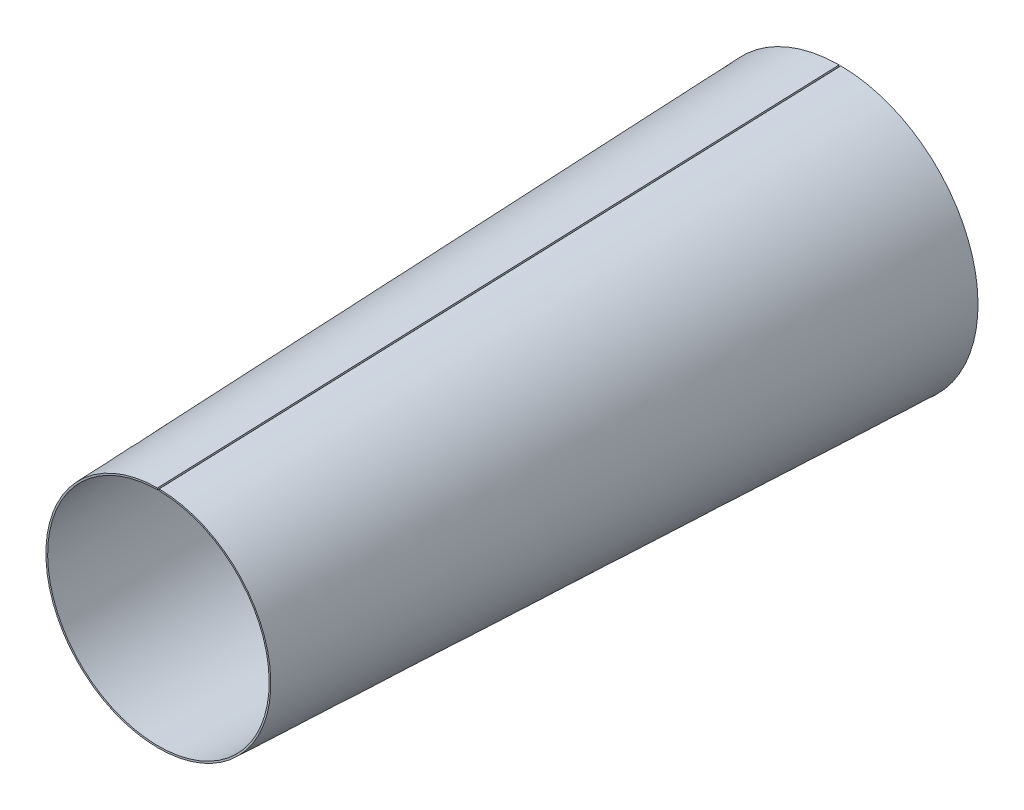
ISO-10303-21;
HEADER;
FILE_DESCRIPTION(('STEP AP214'),'2;1');
FILE_NAME('part.step','',(''),(''),'','','');
FILE_SCHEMA(('AUTOMOTIVE_DESIGN { 1 0 10303 214 1 1 1 1 }'));
ENDSEC;
DATA;
#1=APPLICATION_CONTEXT('core data for automotive mechanical design processes');
#2=APPLICATION_PROTOCOL_DEFINITION('international standard','automotive_design',2000,#1);
#3=PRODUCT_CONTEXT('',#1,'mechanical');
#4=PRODUCT('Part','Part','',(#3));
#5=PRODUCT_RELATED_PRODUCT_CATEGORY('part','',(#4));
#6=PRODUCT_DEFINITION_FORMATION('','',#4);
#7=PRODUCT_DEFINITION_CONTEXT('part definition',#1,'design');
#8=PRODUCT_DEFINITION('design','',#6,#7);
#9=PRODUCT_DEFINITION_SHAPE('','',#8);
#10=(LENGTH_UNIT() NAMED_UNIT(*) SI_UNIT(.MILLI.,.METRE.));
#11=(NAMED_UNIT(*) PLANE_ANGLE_UNIT() SI_UNIT($,.RADIAN.));
#12=(NAMED_UNIT(*) SI_UNIT($,.STERADIAN.) SOLID_ANGLE_UNIT());
#13=UNCERTAINTY_MEASURE_WITH_UNIT(LENGTH_MEASURE(1.E-05),#10,'distance_accuracy_value','');
#14=(GEOMETRIC_REPRESENTATION_CONTEXT(3) GLOBAL_UNCERTAINTY_ASSIGNED_CONTEXT((#13)) GLOBAL_UNIT_ASSIGNED_CONTEXT((#10,
#11,#12)) REPRESENTATION_CONTEXT('',''));
#15=CARTESIAN_POINT('',(0.,0.,0.));
#16=DIRECTION('',(0.,0.,1.));
#17=DIRECTION('',(1.,0.,0.));
#18=AXIS2_PLACEMENT_3D('',#15,#16,#17);
#19=CARTESIAN_POINT('',(-0.25384157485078,32.9986724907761,200.0187367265));
#20=CARTESIAN_POINT('',(-2.40840489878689,32.9820985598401,200.018736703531));
#21=CARTESIAN_POINT('',(-4.56100960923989,32.7539389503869,200.018736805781));
#22=CARTESIAN_POINT('',(-8.78129274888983,31.8828208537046,200.018736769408));
#23=CARTESIAN_POINT('',(-10.8483470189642,31.2399916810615,200.018736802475));
#24=CARTESIAN_POINT('',(-14.8183856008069,29.5641394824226,200.018736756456));
#25=CARTESIAN_POINT('',(-16.720798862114,28.5313572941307,200.018736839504));
#26=CARTESIAN_POINT('',(-20.288788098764,26.1149202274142,200.018736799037));
#27=CARTESIAN_POINT('',(-21.9538449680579,24.7316171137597,200.018736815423));
#28=CARTESIAN_POINT('',(-24.9833214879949,21.6669762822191,200.018736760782));
#29=CARTESIAN_POINT('',(-26.3473002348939,19.9860844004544,200.018736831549));
#30=CARTESIAN_POINT('',(-28.7223975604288,16.3904658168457,200.018736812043));
#31=CARTESIAN_POINT('',(-29.7331721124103,14.4762600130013,200.018736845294));
#32=CARTESIAN_POINT('',(-31.3630881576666,10.4871543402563,200.018736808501));
#33=CARTESIAN_POINT('',(-31.981992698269,8.41283435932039,200.018736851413));
#34=CARTESIAN_POINT('',(-32.8043877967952,4.18279240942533,200.018736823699));
#35=CARTESIAN_POINT('',(-33.0077589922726,2.0276843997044,200.01873685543));
#36=CARTESIAN_POINT('',(-32.9911850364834,-2.28152866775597,200.018736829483));
#37=CARTESIAN_POINT('',(-32.7712422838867,-4.43500771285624,200.018736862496));
#38=CARTESIAN_POINT('',(-31.9163328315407,-8.65859875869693,200.018736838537));
#39=CARTESIAN_POINT('',(-31.2814902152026,-10.7280977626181,200.018736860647));
#40=CARTESIAN_POINT('',(-29.6209373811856,-14.7045469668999,200.01873684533));
#41=CARTESIAN_POINT('',(-28.5954685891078,-16.6109190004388,200.018736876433));
#42=CARTESIAN_POINT('',(-26.1927828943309,-20.1881628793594,200.018736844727));
#43=CARTESIAN_POINT('',(-24.8159138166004,-21.8585168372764,200.018736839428));
#44=CARTESIAN_POINT('',(-21.76295312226,-24.8997603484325,200.018736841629));
#45=CARTESIAN_POINT('',(-20.0873065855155,-26.2702066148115,200.018736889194));
#46=CARTESIAN_POINT('',(-16.5008355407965,-28.6591320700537,200.018736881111));
#47=CARTESIAN_POINT('',(-14.5905305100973,-29.6772651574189,200.01873686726));
#48=CARTESIAN_POINT('',(-10.6077160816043,-31.3225179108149,200.018736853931));
#49=CARTESIAN_POINT('',(-8.53578572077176,-31.9493984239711,200.018736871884));
#50=CARTESIAN_POINT('',(-4.30893201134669,-32.7880577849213,200.018736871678));
#51=CARTESIAN_POINT('',(-2.15462237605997,-32.9997148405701,200.018736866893));
#52=CARTESIAN_POINT('',(2.15462237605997,-32.9997148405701,200.018736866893));
#53=CARTESIAN_POINT('',(4.3089320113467,-32.7880577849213,200.018736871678));
#54=CARTESIAN_POINT('',(8.53578572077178,-31.9493984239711,200.018736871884));
#55=CARTESIAN_POINT('',(10.6077160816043,-31.3225179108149,200.018736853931));
#56=CARTESIAN_POINT('',(14.5905305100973,-29.6772651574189,200.018736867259));
#57=CARTESIAN_POINT('',(16.5008355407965,-28.6591320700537,200.018736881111));
#58=CARTESIAN_POINT('',(20.0873065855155,-26.2702066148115,200.018736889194));
#59=CARTESIAN_POINT('',(21.7629531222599,-24.8997603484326,200.018736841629));
#60=CARTESIAN_POINT('',(24.8159138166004,-21.8585168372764,200.018736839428));
#61=CARTESIAN_POINT('',(26.192782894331,-20.1881628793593,200.018736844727));
#62=CARTESIAN_POINT('',(28.5954685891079,-16.6109190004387,200.018736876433));
#63=CARTESIAN_POINT('',(29.6209373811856,-14.7045469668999,200.01873684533));
#64=CARTESIAN_POINT('',(31.2814902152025,-10.7280977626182,200.018736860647));
#65=CARTESIAN_POINT('',(31.9163328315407,-8.6585987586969,200.018736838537));
#66=CARTESIAN_POINT('',(32.7712422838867,-4.4350077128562,200.018736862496));
#67=CARTESIAN_POINT('',(32.9911850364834,-2.28152866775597,200.018736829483));
#68=CARTESIAN_POINT('',(33.0077589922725,2.02768439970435,200.01873685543));
#69=CARTESIAN_POINT('',(32.8043877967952,4.18279240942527,200.018736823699));
#70=CARTESIAN_POINT('',(31.981992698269,8.41283435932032,200.018736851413));
#71=CARTESIAN_POINT('',(31.3630881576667,10.4871543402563,200.018736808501));
#72=CARTESIAN_POINT('',(29.7331721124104,14.4762600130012,200.018736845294));
#73=CARTESIAN_POINT('',(28.7223975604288,16.3904658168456,200.018736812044));
#74=CARTESIAN_POINT('',(26.3473002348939,19.9860844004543,200.01873683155));
#75=CARTESIAN_POINT('',(24.9833214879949,21.6669762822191,200.018736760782));
#76=CARTESIAN_POINT('',(21.953844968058,24.7316171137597,200.018736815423));
#77=CARTESIAN_POINT('',(20.2887880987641,26.1149202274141,200.018736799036));
#78=CARTESIAN_POINT('',(16.7207988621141,28.5313572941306,200.018736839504));
#79=CARTESIAN_POINT('',(14.818385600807,29.5641394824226,200.018736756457));
#80=CARTESIAN_POINT('',(10.8483470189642,31.2399916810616,200.018736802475));
#81=CARTESIAN_POINT('',(8.78129274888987,31.8828208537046,200.018736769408));
#82=CARTESIAN_POINT('',(4.56100960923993,32.7539389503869,200.01873680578));
#83=CARTESIAN_POINT('',(2.40840489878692,32.9820985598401,200.018736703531));
#84=CARTESIAN_POINT('',(0.253841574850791,32.9986724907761,200.0187367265));
#85=CARTESIAN_POINT('',(-0.249998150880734,32.4990384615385,200.));
#86=CARTESIAN_POINT('',(-2.3718469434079,32.4827161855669,200.));
#87=CARTESIAN_POINT('',(-4.4920626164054,32.2579886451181,200.));
#88=CARTESIAN_POINT('',(-8.6482309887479,31.4001046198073,200.));
#89=CARTESIAN_POINT('',(-10.6841836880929,30.7669481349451,200.));
#90=CARTESIAN_POINT('',(-14.5939261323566,29.1165484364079,200.));
#91=CARTESIAN_POINT('',(-16.4677158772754,28.0993052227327,200.));
#92=CARTESIAN_POINT('',(-19.9815103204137,25.7195718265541,200.));
#93=CARTESIAN_POINT('',(-21.6215150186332,24.3570816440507,200.));
#94=CARTESIAN_POINT('',(-24.6049758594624,21.3389906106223,200.));
#95=CARTESIAN_POINT('',(-25.9484320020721,19.6833897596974,200.));
#96=CARTESIAN_POINT('',(-28.2874547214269,16.1423838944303,200.));
#97=CARTESIAN_POINT('',(-29.283021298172,14.2569788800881,200.));
#98=CARTESIAN_POINT('',(-30.8881804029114,10.328464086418,200.));
#99=CARTESIAN_POINT('',(-31.4977729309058,8.2853543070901,200.));
#100=CARTESIAN_POINT('',(-32.3076767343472,4.1195621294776,200.));
#101=CARTESIAN_POINT('',(-32.5079880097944,1.99687973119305,200.));
#102=CARTESIAN_POINT('',(-32.4916657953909,-2.24688056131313,200.));
#103=CARTESIAN_POINT('',(-32.2750323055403,-4.36795845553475,200.));
#104=CARTESIAN_POINT('',(-31.4331079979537,-8.52739774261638,200.));
#105=CARTESIAN_POINT('',(-30.8078171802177,-10.5657591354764,200.));
#106=CARTESIAN_POINT('',(-29.1724866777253,-14.4818095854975,200.));
#107=CARTESIAN_POINT('',(-28.1624469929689,-16.3594986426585,200.));
#108=CARTESIAN_POINT('',(-25.7962547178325,-19.8824092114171,200.));
#109=CARTESIAN_POINT('',(-24.4401021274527,-21.5276307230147,200.));
#110=CARTESIAN_POINT('',(-21.4335145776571,-24.5226790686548,200.));
#111=CARTESIAN_POINT('',(-19.7830796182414,-25.8725059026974,200.));
#112=CARTESIAN_POINT('',(-16.2510819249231,-28.2251470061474,200.));
#113=CARTESIAN_POINT('',(-14.3695191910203,-29.2279612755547,200.));
#114=CARTESIAN_POINT('',(-10.4472002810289,-30.8482240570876,200.));
#115=CARTESIAN_POINT('',(-8.40644410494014,-31.4656725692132,200.));
#116=CARTESIAN_POINT('',(-4.24379195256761,-32.2915935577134,200.));
#117=CARTESIAN_POINT('',(-2.1218959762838,-32.500066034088,200.));
#118=CARTESIAN_POINT('',(2.12189597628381,-32.500066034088,200.));
#119=CARTESIAN_POINT('',(4.24379195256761,-32.2915935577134,200.));
#120=CARTESIAN_POINT('',(8.40644410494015,-31.4656725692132,200.));
#121=CARTESIAN_POINT('',(10.4472002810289,-30.8482240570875,200.));
#122=CARTESIAN_POINT('',(14.3695191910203,-29.2279612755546,200.));
#123=CARTESIAN_POINT('',(16.2510819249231,-28.2251470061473,200.));
#124=CARTESIAN_POINT('',(19.7830796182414,-25.8725059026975,200.));
#125=CARTESIAN_POINT('',(21.4335145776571,-24.5226790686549,200.));
#126=CARTESIAN_POINT('',(24.4401021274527,-21.5276307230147,200.));
#127=CARTESIAN_POINT('',(25.7962547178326,-19.8824092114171,200.));
#128=CARTESIAN_POINT('',(28.1624469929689,-16.3594986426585,200.));
#129=CARTESIAN_POINT('',(29.1724866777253,-14.4818095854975,200.));
#130=CARTESIAN_POINT('',(30.8078171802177,-10.5657591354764,200.));
#131=CARTESIAN_POINT('',(31.4331079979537,-8.52739774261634,200.));
#132=CARTESIAN_POINT('',(32.2750323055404,-4.36795845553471,200.));
#133=CARTESIAN_POINT('',(32.4916657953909,-2.24688056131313,200.));
#134=CARTESIAN_POINT('',(32.5079880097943,1.99687973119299,200.));
#135=CARTESIAN_POINT('',(32.3076767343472,4.11956212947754,200.));
#136=CARTESIAN_POINT('',(31.4977729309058,8.28535430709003,200.));
#137=CARTESIAN_POINT('',(30.8881804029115,10.328464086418,200.));
#138=CARTESIAN_POINT('',(29.2830212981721,14.256978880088,200.));
#139=CARTESIAN_POINT('',(28.2874547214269,16.1423838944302,200.));
#140=CARTESIAN_POINT('',(25.9484320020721,19.6833897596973,200.));
#141=CARTESIAN_POINT('',(24.6049758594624,21.3389906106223,200.));
#142=CARTESIAN_POINT('',(21.6215150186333,24.3570816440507,200.));
#143=CARTESIAN_POINT('',(19.9815103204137,25.7195718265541,200.));
#144=CARTESIAN_POINT('',(16.4677158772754,28.0993052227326,200.));
#145=CARTESIAN_POINT('',(14.5939261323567,29.1165484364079,200.000000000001));
#146=CARTESIAN_POINT('',(10.6841836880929,30.7669481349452,200.));
#147=CARTESIAN_POINT('',(8.64823098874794,31.4001046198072,200.));
#148=CARTESIAN_POINT('',(4.49206261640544,32.2579886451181,200.));
#149=CARTESIAN_POINT('',(2.37184694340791,32.4827161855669,200.));
#150=CARTESIAN_POINT('',(0.249998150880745,32.4990384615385,200.));
#151=B_SPLINE_SURFACE_WITH_KNOTS('',1,3,((#19,#20,#21,#22,#23,#24,#25,#26,#27,#28,#29,#30,#31,
#32,#33,#34,#35,#36,#37,#38,#39,#40,#41,#42,#43,#44,#45,#46,#47,#48,#49,#50,#51,#52,#53,#54,#55,
#56,#57,#58,#59,#60,#61,#62,#63,#64,#65,#66,#67,#68,#69,#70,#71,#72,#73,#74,#75,#76,#77,#78,#79,
#80,#81,#82,#83,#84),(#85,#86,#87,#88,#89,#90,#91,#92,#93,#94,#95,#96,#97,#98,#99,#100,#101,
#102,#103,#104,#105,#106,#107,#108,#109,#110,#111,#112,#113,#114,#115,#116,#117,#118,#119,#120,
#121,#122,#123,#124,#125,#126,#127,#128,#129,#130,#131,#132,#133,#134,#135,#136,#137,#138,#139,
#140,#141,#142,#143,#144,#145,#146,#147,#148,#149,#150)),.UNSPECIFIED.,.F.,.F.,.F.,(2,2),(4,2,2,
2,2,2,2,2,2,2,2,2,2,2,2,2,2,2,2,2,2,2,2,2,2,2,2,2,2,2,2,2,4),(0.,1.),(0.,0.03125,0.0625,0.09375,
0.125,0.15625,0.1875,0.21875,0.25,0.28125,0.3125,0.34375,0.375,0.40625,0.4375,0.46875,0.5,
0.53125,0.5625,0.59375,0.625,0.65625,0.6875,0.71875,0.75,0.78125,0.8125,0.84375,0.875,0.90625,
0.9375,0.96875,1.),.UNSPECIFIED.);
#152=CARTESIAN_POINT('',(0.249998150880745,32.4990384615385,200.));
#153=CARTESIAN_POINT('',(0.253841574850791,32.9986724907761,200.0187367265));
#154=B_SPLINE_CURVE_WITH_KNOTS('',1,(#152,#153),.UNSPECIFIED.,.F.,.F.,(2,2),(0.,1.),.UNSPECIFIED.);
#155=CARTESIAN_POINT('',(0.249998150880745,32.4990384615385,200.));
#156=VERTEX_POINT('',#155);
#157=CARTESIAN_POINT('',(0.253841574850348,32.9986724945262,200.0187366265));
#158=VERTEX_POINT('',#157);
#159=EDGE_CURVE('E120',#156,#158,#154,.T.);
#160=CARTESIAN_POINT('',(0.249998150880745,32.4990384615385,200.));
#161=CARTESIAN_POINT('',(2.37184694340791,32.4827161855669,200.));
#162=CARTESIAN_POINT('',(4.49206261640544,32.2579886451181,200.));
#163=CARTESIAN_POINT('',(8.64823098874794,31.4001046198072,200.));
#164=CARTESIAN_POINT('',(10.6841836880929,30.7669481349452,200.));
#165=CARTESIAN_POINT('',(14.5939261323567,29.1165484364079,200.000000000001));
#166=CARTESIAN_POINT('',(16.4677158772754,28.0993052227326,200.));
#167=CARTESIAN_POINT('',(19.9815103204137,25.7195718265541,200.));
#168=CARTESIAN_POINT('',(21.6215150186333,24.3570816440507,200.));
#169=CARTESIAN_POINT('',(24.6049758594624,21.3389906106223,200.));
#170=CARTESIAN_POINT('',(25.9484320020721,19.6833897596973,200.));
#171=CARTESIAN_POINT('',(28.2874547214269,16.1423838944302,200.));
#172=CARTESIAN_POINT('',(29.2830212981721,14.256978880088,200.));
#173=CARTESIAN_POINT('',(30.8881804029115,10.328464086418,200.));
#174=CARTESIAN_POINT('',(31.4977729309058,8.28535430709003,200.));
#175=CARTESIAN_POINT('',(32.3076767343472,4.11956212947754,200.));
#176=CARTESIAN_POINT('',(32.5079880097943,1.99687973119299,200.));
#177=CARTESIAN_POINT('',(32.4916657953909,-2.24688056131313,200.));
#178=CARTESIAN_POINT('',(32.2750323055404,-4.36795845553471,200.));
#179=CARTESIAN_POINT('',(31.4331079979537,-8.52739774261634,200.));
#180=CARTESIAN_POINT('',(30.8078171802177,-10.5657591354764,200.));
#181=CARTESIAN_POINT('',(29.1724866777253,-14.4818095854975,200.));
#182=CARTESIAN_POINT('',(28.1624469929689,-16.3594986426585,200.));
#183=CARTESIAN_POINT('',(25.7962547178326,-19.8824092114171,200.));
#184=CARTESIAN_POINT('',(24.4401021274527,-21.5276307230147,200.));
#185=CARTESIAN_POINT('',(21.4335145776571,-24.5226790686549,200.));
#186=CARTESIAN_POINT('',(19.7830796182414,-25.8725059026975,200.));
#187=CARTESIAN_POINT('',(16.2510819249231,-28.2251470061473,200.));
#188=CARTESIAN_POINT('',(14.3695191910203,-29.2279612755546,200.));
#189=CARTESIAN_POINT('',(10.4472002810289,-30.8482240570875,200.));
#190=CARTESIAN_POINT('',(8.40644410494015,-31.4656725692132,200.));
#191=CARTESIAN_POINT('',(4.24379195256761,-32.2915935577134,200.));
#192=CARTESIAN_POINT('',(2.12189597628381,-32.500066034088,200.));
#193=CARTESIAN_POINT('',(-2.1218959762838,-32.500066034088,200.));
#194=CARTESIAN_POINT('',(-4.24379195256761,-32.2915935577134,200.));
#195=CARTESIAN_POINT('',(-8.40644410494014,-31.4656725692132,200.));
#196=CARTESIAN_POINT('',(-10.4472002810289,-30.8482240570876,200.));
#197=CARTESIAN_POINT('',(-14.3695191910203,-29.2279612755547,200.));
#198=CARTESIAN_POINT('',(-16.2510819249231,-28.2251470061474,200.));
#199=CARTESIAN_POINT('',(-19.7830796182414,-25.8725059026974,200.));
#200=CARTESIAN_POINT('',(-21.4335145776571,-24.5226790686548,200.));
#201=CARTESIAN_POINT('',(-24.4401021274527,-21.5276307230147,200.));
#202=CARTESIAN_POINT('',(-25.7962547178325,-19.8824092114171,200.));
#203=CARTESIAN_POINT('',(-28.1624469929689,-16.3594986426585,200.));
#204=CARTESIAN_POINT('',(-29.1724866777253,-14.4818095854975,200.));
#205=CARTESIAN_POINT('',(-30.8078171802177,-10.5657591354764,200.));
#206=CARTESIAN_POINT('',(-31.4331079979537,-8.52739774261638,200.));
#207=CARTESIAN_POINT('',(-32.2750323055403,-4.36795845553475,200.));
#208=CARTESIAN_POINT('',(-32.4916657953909,-2.24688056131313,200.));
#209=CARTESIAN_POINT('',(-32.5079880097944,1.99687973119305,200.));
#210=CARTESIAN_POINT('',(-32.3076767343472,4.1195621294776,200.));
#211=CARTESIAN_POINT('',(-31.4977729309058,8.2853543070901,200.));
#212=CARTESIAN_POINT('',(-30.8881804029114,10.328464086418,200.));
#213=CARTESIAN_POINT('',(-29.283021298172,14.2569788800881,200.));
#214=CARTESIAN_POINT('',(-28.2874547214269,16.1423838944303,200.));
#215=CARTESIAN_POINT('',(-25.9484320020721,19.6833897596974,200.));
#216=CARTESIAN_POINT('',(-24.6049758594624,21.3389906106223,200.));
#217=CARTESIAN_POINT('',(-21.6215150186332,24.3570816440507,200.));
#218=CARTESIAN_POINT('',(-19.9815103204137,25.7195718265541,200.));
#219=CARTESIAN_POINT('',(-16.4677158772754,28.0993052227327,200.));
#220=CARTESIAN_POINT('',(-14.5939261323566,29.1165484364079,200.));
#221=CARTESIAN_POINT('',(-10.6841836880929,30.7669481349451,200.));
#222=CARTESIAN_POINT('',(-8.6482309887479,31.4001046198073,200.));
#223=CARTESIAN_POINT('',(-4.4920626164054,32.2579886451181,200.));
#224=CARTESIAN_POINT('',(-2.3718469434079,32.4827161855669,200.));
#225=CARTESIAN_POINT('',(-0.249998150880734,32.4990384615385,200.));
#226=B_SPLINE_CURVE_WITH_KNOTS('',3,(#160,#161,#162,#163,#164,#165,#166,#167,#168,#169,#170,
#171,#172,#173,#174,#175,#176,#177,#178,#179,#180,#181,#182,#183,#184,#185,#186,#187,#188,#189,
#190,#191,#192,#193,#194,#195,#196,#197,#198,#199,#200,#201,#202,#203,#204,#205,#206,#207,#208,
#209,#210,#211,#212,#213,#214,#215,#216,#217,#218,#219,#220,#221,#222,#223,#224,#225),
.UNSPECIFIED.,.F.,.F.,(4,2,2,2,2,2,2,2,2,2,2,2,2,2,2,2,2,2,2,2,2,2,2,2,2,2,2,2,2,2,2,2,4),(0.,
0.03125,0.0625,0.09375,0.125,0.15625,0.1875,0.21875,0.25,0.28125,0.3125,0.34375,0.375,0.40625,
0.4375,0.46875,0.5,0.53125,0.5625,0.59375,0.625,0.65625,0.6875,0.71875,0.75,0.78125,0.8125,
0.84375,0.875,0.90625,0.9375,0.96875,1.),.UNSPECIFIED.);
#227=CARTESIAN_POINT('',(-0.249998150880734,32.4990384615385,200.));
#228=VERTEX_POINT('',#227);
#229=EDGE_CURVE('E350',#156,#228,#226,.T.);
#230=CARTESIAN_POINT('',(-0.249998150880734,32.4990384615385,200.));
#231=CARTESIAN_POINT('',(-0.25384157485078,32.9986724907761,200.0187367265));
#232=B_SPLINE_CURVE_WITH_KNOTS('',1,(#230,#231),.UNSPECIFIED.,.F.,.F.,(2,2),(0.,1.),.UNSPECIFIED.);
#233=CARTESIAN_POINT('',(-0.253841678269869,32.9986724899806,200.0187367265));
#234=VERTEX_POINT('',#233);
#235=EDGE_CURVE('E183',#228,#234,#232,.T.);
#236=CARTESIAN_POINT('',(0.253841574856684,32.998672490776,200.018736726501));
#237=CARTESIAN_POINT('',(0.792468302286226,32.9945292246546,200.018736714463));
#238=CARTESIAN_POINT('',(1.33098964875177,32.977160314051,200.018736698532));
#239=CARTESIAN_POINT('',(2.40652142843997,32.9161045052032,200.018736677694));
#240=CARTESIAN_POINT('',(2.9435319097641,32.8724184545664,200.018736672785));
#241=CARTESIAN_POINT('',(4.0147761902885,32.7588614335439,200.018736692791));
#242=CARTESIAN_POINT('',(4.54900999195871,32.6889904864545,200.018736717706));
#243=CARTESIAN_POINT('',(5.61343800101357,32.5231933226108,200.018736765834));
#244=CARTESIAN_POINT('',(6.14363208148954,32.4272662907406,200.018736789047));
#245=CARTESIAN_POINT('',(7.19867240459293,32.2094930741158,200.018736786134));
#246=CARTESIAN_POINT('',(7.72351862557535,32.0876467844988,200.018736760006));
#247=CARTESIAN_POINT('',(8.7666057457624,31.8184258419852,200.018736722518));
#248=CARTESIAN_POINT('',(9.28484682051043,31.6710518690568,200.018736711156));
#249=CARTESIAN_POINT('',(10.313509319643,31.3511577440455,200.018736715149));
#250=CARTESIAN_POINT('',(10.8239307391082,31.1786375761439,200.018736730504));
#251=CARTESIAN_POINT('',(11.8357386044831,30.8088297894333,200.018736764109));
#252=CARTESIAN_POINT('',(12.3371248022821,30.6115414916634,200.01873678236));
#253=CARTESIAN_POINT('',(13.3296064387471,30.192590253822,200.018736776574));
#254=CARTESIAN_POINT('',(13.8207019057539,29.9709273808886,200.018736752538));
#255=CARTESIAN_POINT('',(14.7914456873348,29.5038517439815,200.01873672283));
#256=CARTESIAN_POINT('',(15.271094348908,29.2584397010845,200.018736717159));
#257=CARTESIAN_POINT('',(16.217828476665,28.7444738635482,200.018736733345));
#258=CARTESIAN_POINT('',(16.6849139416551,28.4759200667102,200.018736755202));
#259=CARTESIAN_POINT('',(17.6054039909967,27.9162756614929,200.018736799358));
#260=CARTESIAN_POINT('',(18.0588081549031,27.6251843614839,200.018736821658));
#261=CARTESIAN_POINT('',(18.9507800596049,27.0210923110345,200.018736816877));
#262=CARTESIAN_POINT('',(19.3893477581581,26.7080914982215,200.018736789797));
#263=CARTESIAN_POINT('',(20.2506331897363,26.0610197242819,200.018736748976));
#264=CARTESIAN_POINT('',(20.6733513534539,25.7269493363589,200.018736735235));
#265=CARTESIAN_POINT('',(21.501960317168,25.0385535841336,200.018736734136));
#266=CARTESIAN_POINT('',(21.9078511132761,24.6842282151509,200.018736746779));
#267=CARTESIAN_POINT('',(22.7018257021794,23.9561348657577,200.018736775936));
#268=CARTESIAN_POINT('',(23.0899090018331,23.5823663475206,200.018736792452));
#269=CARTESIAN_POINT('',(23.8472565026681,22.816228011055,200.018736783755));
#270=CARTESIAN_POINT('',(24.2165207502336,22.4238582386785,200.018736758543));
#271=CARTESIAN_POINT('',(24.9354000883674,21.6215375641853,200.018736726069));
#272=CARTESIAN_POINT('',(25.2850157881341,21.2115872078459,200.018736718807));
#273=CARTESIAN_POINT('',(25.9637991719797,20.3750945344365,200.018736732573));
#274=CARTESIAN_POINT('',(26.2929668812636,19.9485522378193,200.018736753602));
#275=CARTESIAN_POINT('',(26.9300526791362,19.0798625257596,200.018736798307));
#276=CARTESIAN_POINT('',(27.2379701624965,18.637714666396,200.018736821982));
#277=CARTESIAN_POINT('',(27.8317276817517,17.7388354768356,200.018736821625));
#278=CARTESIAN_POINT('',(28.1175677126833,17.2821041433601,200.018736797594));
#279=CARTESIAN_POINT('',(28.6665542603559,16.3552199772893,200.018736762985));
#280=CARTESIAN_POINT('',(28.9297014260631,15.8850675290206,200.018736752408));
#281=CARTESIAN_POINT('',(29.432710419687,14.932466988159,200.018736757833));
#282=CARTESIAN_POINT('',(29.6725722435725,14.4500188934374,200.018736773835));
#283=CARTESIAN_POINT('',(30.1284155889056,13.4739511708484,200.01873680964));
#284=CARTESIAN_POINT('',(30.3443964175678,12.9803312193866,200.018736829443));
#285=CARTESIAN_POINT('',(30.7518638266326,11.9830831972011,200.018736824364));
#286=CARTESIAN_POINT('',(30.9433504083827,11.4794551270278,200.018736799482));
#287=CARTESIAN_POINT('',(31.3014513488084,10.4634507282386,200.018736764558));
#288=CARTESIAN_POINT('',(31.4680664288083,9.9510746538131,200.018736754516));
#289=CARTESIAN_POINT('',(31.776063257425,8.91879375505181,200.0187367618));
#290=CARTESIAN_POINT('',(31.9174450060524,8.39888893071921,200.018736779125));
#291=CARTESIAN_POINT('',(32.1746106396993,7.35276894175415,200.01873681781));
#292=CARTESIAN_POINT('',(32.2903937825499,6.82655359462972,200.01873683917));
#293=CARTESIAN_POINT('',(32.4959867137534,5.76907316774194,200.018736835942));
#294=CARTESIAN_POINT('',(32.5857964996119,5.23780808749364,200.018736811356));
#295=CARTESIAN_POINT('',(32.7393170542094,4.17153748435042,200.018736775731));
#296=CARTESIAN_POINT('',(32.8030285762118,3.63653206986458,200.018736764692));
#297=CARTESIAN_POINT('',(32.9042356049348,2.56404730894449,200.018736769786));
#298=CARTESIAN_POINT('',(32.941731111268,2.02656796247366,200.01873678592));
#299=CARTESIAN_POINT('',(32.9903855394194,0.950401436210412,200.018736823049));
#300=CARTESIAN_POINT('',(33.0015436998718,0.411714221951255,200.018736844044));
#301=CARTESIAN_POINT('',(32.9974003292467,-0.665558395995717,200.018736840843));
#302=CARTESIAN_POINT('',(32.9820988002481,-1.20414379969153,200.018736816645));
#303=CARTESIAN_POINT('',(32.9251676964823,-2.27990409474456,200.018736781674));
#304=CARTESIAN_POINT('',(32.8835388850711,-2.81707902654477,200.018736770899));
#305=CARTESIAN_POINT('',(32.7740850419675,-3.88875338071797,200.018736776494));
#306=CARTESIAN_POINT('',(32.706260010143,-4.42325280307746,200.018736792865));
#307=CARTESIAN_POINT('',(32.5445419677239,-5.48831085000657,200.018736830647));
#308=CARTESIAN_POINT('',(32.4506482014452,-6.01886935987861,200.018736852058));
#309=CARTESIAN_POINT('',(32.2369269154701,-7.07473710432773,200.018736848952));
#310=CARTESIAN_POINT('',(32.1170993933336,-7.60004633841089,200.018736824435));
#311=CARTESIAN_POINT('',(31.8518943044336,-8.64415741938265,200.018736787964));
#312=CARTESIAN_POINT('',(31.7065174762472,-9.16295945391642,200.018736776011));
#313=CARTESIAN_POINT('',(31.3905891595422,-10.1928408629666,200.018736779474));
#314=CARTESIAN_POINT('',(31.2200376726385,-10.7039202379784,200.01873679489));
#315=CARTESIAN_POINT('',(30.8541319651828,-11.7171400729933,200.018736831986));
#316=CARTESIAN_POINT('',(30.6587770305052,-12.2192802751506,200.018736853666));
#317=CARTESIAN_POINT('',(30.2436506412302,-13.2133642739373,200.018736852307));
#318=CARTESIAN_POINT('',(30.0238791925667,-13.7053080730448,200.018736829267));
#319=CARTESIAN_POINT('',(29.5605412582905,-14.6778400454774,200.018736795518));
#320=CARTESIAN_POINT('',(29.3169754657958,-15.1584285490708,200.018736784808));
#321=CARTESIAN_POINT('',(28.8066537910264,-16.1071312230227,200.018736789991));
#322=CARTESIAN_POINT('',(28.5398979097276,-16.575245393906,200.018736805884));
#323=CARTESIAN_POINT('',(27.9837978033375,-17.4978790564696,200.018736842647));
#324=CARTESIAN_POINT('',(27.6944529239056,-17.9523981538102,200.018736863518));
#325=CARTESIAN_POINT('',(27.0937985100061,-18.8466837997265,200.018736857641));
#326=CARTESIAN_POINT('',(26.782488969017,-19.2864503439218,200.018736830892));
#327=CARTESIAN_POINT('',(26.1387397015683,-20.1502145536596,200.01873678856));
#328=CARTESIAN_POINT('',(25.8063005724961,-20.5742126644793,200.018736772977));
#329=CARTESIAN_POINT('',(25.121102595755,-21.4054600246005,200.018736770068));
#330=CARTESIAN_POINT('',(24.7683437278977,-21.8127092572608,200.018736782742));
#331=CARTESIAN_POINT('',(24.0433139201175,-22.6094766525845,200.018736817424));
#332=CARTESIAN_POINT('',(23.671042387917,-22.9989942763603,200.018736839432));
#333=CARTESIAN_POINT('',(22.9078240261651,-23.759283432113,200.018736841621));
#334=CARTESIAN_POINT('',(22.5168771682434,-24.1300549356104,200.018736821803));
#335=CARTESIAN_POINT('',(21.7173256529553,-24.8520175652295,200.018736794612));
#336=CARTESIAN_POINT('',(21.308721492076,-25.2032092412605,200.018736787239));
#337=CARTESIAN_POINT('',(20.4748421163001,-25.8852090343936,200.018736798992));
#338=CARTESIAN_POINT('',(20.0495668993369,-26.2160171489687,200.018736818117));
#339=CARTESIAN_POINT('',(19.183329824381,-26.8564438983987,200.018736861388));
#340=CARTESIAN_POINT('',(18.7423675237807,-27.1660619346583,200.018736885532));
#341=CARTESIAN_POINT('',(17.8457752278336,-27.7632763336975,200.018736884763));
#342=CARTESIAN_POINT('',(17.3901452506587,-28.0508727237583,200.018736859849));
#343=CARTESIAN_POINT('',(16.465377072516,-28.6034232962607,200.01873681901));
#344=CARTESIAN_POINT('',(15.9962392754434,-28.8683781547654,200.018736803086));
#345=CARTESIAN_POINT('',(15.045578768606,-29.3750496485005,200.018736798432));
#346=CARTESIAN_POINT('',(14.5640560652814,-29.6167662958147,200.018736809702));
#347=CARTESIAN_POINT('',(13.5897472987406,-30.0763622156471,200.018736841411));
#348=CARTESIAN_POINT('',(13.0969609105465,-30.2942407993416,200.018736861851));
#349=CARTESIAN_POINT('',(12.1012856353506,-30.7055422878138,200.018736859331));
#350=CARTESIAN_POINT('',(11.598396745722,-30.8989651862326,200.018736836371));
#351=CARTESIAN_POINT('',(10.5837749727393,-31.260972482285,200.018736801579));
#352=CARTESIAN_POINT('',(10.0720423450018,-31.429557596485,200.018736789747));
#353=CARTESIAN_POINT('',(9.04095137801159,-31.7415234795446,200.018736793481));
#354=CARTESIAN_POINT('',(8.52159303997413,-31.884904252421,200.018736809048));
#355=CARTESIAN_POINT('',(7.47646782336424,-32.1460921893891,200.018736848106));
#356=CARTESIAN_POINT('',(6.9507007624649,-32.2638986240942,200.018736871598));
#357=CARTESIAN_POINT('',(5.89401739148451,-32.473557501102,200.018736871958));
#358=CARTESIAN_POINT('',(5.363101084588,-32.5654099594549,200.018736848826));
#359=CARTESIAN_POINT('',(4.29742797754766,-32.7230302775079,200.018736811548));
#360=CARTESIAN_POINT('',(3.76267129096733,-32.7887989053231,200.018736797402));
#361=CARTESIAN_POINT('',(2.69058337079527,-32.8941298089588,200.018736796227));
#362=CARTESIAN_POINT('',(2.15325213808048,-32.933692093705,200.018736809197));
#363=CARTESIAN_POINT('',(1.0772806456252,-32.9864849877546,200.018736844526));
#364=CARTESIAN_POINT('',(0.538640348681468,-32.9997148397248,200.018736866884));
#365=CARTESIAN_POINT('',(-0.538640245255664,-32.9997148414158,200.018736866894));
#366=CARTESIAN_POINT('',(-1.07728054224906,-32.9864849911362,200.018736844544));
#367=CARTESIAN_POINT('',(-2.15325203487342,-32.9336921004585,200.018736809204));
#368=CARTESIAN_POINT('',(-2.69058326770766,-32.8941298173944,200.018736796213));
#369=CARTESIAN_POINT('',(-3.76267118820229,-32.7887989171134,200.018736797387));
#370=CARTESIAN_POINT('',(-4.29742787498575,-32.7230302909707,200.018736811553));
#371=CARTESIAN_POINT('',(-5.36310098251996,-32.5654099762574,200.018736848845));
#372=CARTESIAN_POINT('',(-5.89401728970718,-32.4735575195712,200.018736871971));
#373=CARTESIAN_POINT('',(-6.95070066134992,-32.2638986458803,200.01873687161));
#374=CARTESIAN_POINT('',(-7.4764677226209,-32.1460922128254,200.018736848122));
#375=CARTESIAN_POINT('',(-8.52159294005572,-31.884904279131,200.018736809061));
#376=CARTESIAN_POINT('',(-9.04095127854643,-31.7415235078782,200.018736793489));
#377=CARTESIAN_POINT('',(-10.0720422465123,-31.4295576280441,200.018736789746));
#378=CARTESIAN_POINT('',(-10.5837748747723,-31.2609725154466,200.018736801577));
#379=CARTESIAN_POINT('',(-11.5983966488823,-30.8989652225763,200.018736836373));
#380=CARTESIAN_POINT('',(-12.1012855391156,-30.7055423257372,200.018736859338));
#381=CARTESIAN_POINT('',(-13.0969608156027,-30.2942408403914,200.018736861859));
#382=CARTESIAN_POINT('',(-13.5897472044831,-30.0763622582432,200.018736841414));
#383=CARTESIAN_POINT('',(-14.5640559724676,-29.6167663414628,200.018736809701));
#384=CARTESIAN_POINT('',(-15.0455786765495,-29.3750496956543,200.018736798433));
#385=CARTESIAN_POINT('',(-15.9962391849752,-28.8683782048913,200.018736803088));
#386=CARTESIAN_POINT('',(-16.4653769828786,-28.603423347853,200.018736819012));
#387=CARTESIAN_POINT('',(-17.3901451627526,-28.0508727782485,200.018736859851));
#388=CARTESIAN_POINT('',(-17.8457751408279,-27.7632763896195,200.018736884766));
#389=CARTESIAN_POINT('',(-18.742367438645,-27.1660619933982,200.018736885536));
#390=CARTESIAN_POINT('',(-19.183329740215,-26.8564439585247,200.018736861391));
#391=CARTESIAN_POINT('',(-20.0495668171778,-26.21601721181,200.018736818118));
#392=CARTESIAN_POINT('',(-20.4748420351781,-25.8852090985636,200.01873679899));
#393=CARTESIAN_POINT('',(-21.3087214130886,-25.2032093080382,200.018736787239));
#394=CARTESIAN_POINT('',(-21.7173255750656,-24.8520176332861,200.018736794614));
#395=CARTESIAN_POINT('',(-22.5168770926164,-24.1300550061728,200.018736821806));
#396=CARTESIAN_POINT('',(-22.9078239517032,-23.7592835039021,200.018736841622));
#397=CARTESIAN_POINT('',(-23.6710423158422,-22.9989943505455,200.018736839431));
#398=CARTESIAN_POINT('',(-24.0433138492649,-22.6094767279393,200.018736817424));
#399=CARTESIAN_POINT('',(-24.7683436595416,-21.8127093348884,200.018736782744));
#400=CARTESIAN_POINT('',(-25.1211025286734,-21.4054601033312,200.018736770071));
#401=CARTESIAN_POINT('',(-25.8063005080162,-20.5742127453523,200.018736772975));
#402=CARTESIAN_POINT('',(-26.1387396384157,-20.1502146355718,200.018736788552));
#403=CARTESIAN_POINT('',(-26.7824889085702,-19.2864504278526,200.018736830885));
#404=CARTESIAN_POINT('',(-27.0937984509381,-18.846683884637,200.018736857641));
#405=CARTESIAN_POINT('',(-27.6944528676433,-17.9523982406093,200.01873686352));
#406=CARTESIAN_POINT('',(-27.9837977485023,-17.4978791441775,200.018736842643));
#407=CARTESIAN_POINT('',(-28.5398978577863,-16.575245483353,200.018736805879));
#408=CARTESIAN_POINT('',(-28.8066537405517,-16.1071313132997,200.018736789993));
#409=CARTESIAN_POINT('',(-29.3169754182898,-15.1584286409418,200.018736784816));
#410=CARTESIAN_POINT('',(-29.5605412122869,-14.6778401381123,200.018736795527));
#411=CARTESIAN_POINT('',(-30.0238791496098,-13.7053081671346,200.018736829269));
#412=CARTESIAN_POINT('',(-30.2436505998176,-13.2133643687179,200.018736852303));
#413=CARTESIAN_POINT('',(-30.6587769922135,-12.2192803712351,200.018736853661));
#414=CARTESIAN_POINT('',(-30.8541319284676,-11.7171401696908,200.018736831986));
#415=CARTESIAN_POINT('',(-31.2200376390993,-10.7039203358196,200.018736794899));
#416=CARTESIAN_POINT('',(-31.3905891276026,-10.1928409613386,200.018736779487));
#417=CARTESIAN_POINT('',(-31.706517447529,-9.1629595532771,200.018736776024));
#418=CARTESIAN_POINT('',(-31.8518942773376,-8.64415751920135,200.018736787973));
#419=CARTESIAN_POINT('',(-32.1170993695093,-7.60004643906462,200.018736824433));
#420=CARTESIAN_POINT('',(-32.2369268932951,-7.07473720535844,200.018736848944));
#421=CARTESIAN_POINT('',(-32.4506481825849,-6.01886946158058,200.018736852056));
#422=CARTESIAN_POINT('',(-32.544541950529,-5.48831095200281,200.018736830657));
#423=CARTESIAN_POINT('',(-32.7062599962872,-4.42325290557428,200.01873679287));
#424=CARTESIAN_POINT('',(-32.7740850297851,-3.88875348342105,200.018736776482));
#425=CARTESIAN_POINT('',(-32.8835388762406,-2.81707912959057,200.018736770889));
#426=CARTESIAN_POINT('',(-32.9251676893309,-2.27990419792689,200.018736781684));
#427=CARTESIAN_POINT('',(-32.9820987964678,-1.20414390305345,200.018736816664));
#428=CARTESIAN_POINT('',(-32.9974003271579,-0.66555849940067,200.018736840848));
#429=CARTESIAN_POINT('',(-33.0015437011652,0.411714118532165,200.018736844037));
#430=CARTESIAN_POINT('',(-32.9903855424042,0.950401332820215,200.018736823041));
#431=CARTESIAN_POINT('',(-32.9417311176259,2.02656785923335,200.018736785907));
#432=CARTESIAN_POINT('',(-32.9042356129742,2.56404720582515,200.018736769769));
#433=CARTESIAN_POINT('',(-32.803028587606,3.63653196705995,200.01873676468));
#434=CARTESIAN_POINT('',(-32.7393170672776,4.17153738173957,200.01873677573));
#435=CARTESIAN_POINT('',(-32.5857965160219,5.23780798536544,200.018736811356));
#436=CARTESIAN_POINT('',(-32.4959867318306,5.76907306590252,200.018736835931));
#437=CARTESIAN_POINT('',(-32.2903938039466,6.82655349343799,200.018736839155));
#438=CARTESIAN_POINT('',(-32.1746106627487,7.35276884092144,200.018736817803));
#439=CARTESIAN_POINT('',(-31.9174450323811,8.39888883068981,200.018736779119));
#440=CARTESIAN_POINT('',(-31.7760632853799,8.91879365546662,200.018736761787));
#441=CARTESIAN_POINT('',(-31.4680664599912,9.9510745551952,200.018736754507));
#442=CARTESIAN_POINT('',(-31.3014513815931,10.4634506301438,200.018736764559));
#443=CARTESIAN_POINT('',(-30.943350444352,11.4794550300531,200.018736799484));
#444=CARTESIAN_POINT('',(-30.751863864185,11.9830831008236,200.018736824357));
#445=CARTESIAN_POINT('',(-30.3443964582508,12.9803311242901,200.018736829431));
#446=CARTESIAN_POINT('',(-30.1284156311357,13.4739510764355,200.018736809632));
#447=CARTESIAN_POINT('',(-29.6725722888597,14.4500188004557,200.018736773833));
#448=CARTESIAN_POINT('',(-29.4327104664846,14.9324668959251,200.018736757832));
#449=CARTESIAN_POINT('',(-28.9297014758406,15.8850674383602,200.018736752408));
#450=CARTESIAN_POINT('',(-28.6665543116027,16.3552198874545,200.018736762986));
#451=CARTESIAN_POINT('',(-28.1175677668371,17.2821040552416,200.018736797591));
#452=CARTESIAN_POINT('',(-27.8317277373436,17.738835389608,200.018736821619));
#453=CARTESIAN_POINT('',(-27.2379702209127,18.6377145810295,200.018736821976));
#454=CARTESIAN_POINT('',(-26.9300527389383,19.0798624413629,200.018736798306));
#455=CARTESIAN_POINT('',(-26.2929669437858,19.9485521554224,200.018736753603));
#456=CARTESIAN_POINT('',(-25.9637992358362,20.3750944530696,200.01873673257));
#457=CARTESIAN_POINT('',(-25.2850158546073,21.2115871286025,200.018736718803));
#458=CARTESIAN_POINT('',(-24.9354001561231,21.6215374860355,200.01873672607));
#459=CARTESIAN_POINT('',(-24.2165208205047,22.4238581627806,200.018736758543));
#460=CARTESIAN_POINT('',(-23.8472565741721,22.8162279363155,200.018736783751));
#461=CARTESIAN_POINT('',(-23.0899090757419,23.5823662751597,200.018736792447));
#462=CARTESIAN_POINT('',(-22.7018257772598,23.9561347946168,200.018736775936));
#463=CARTESIAN_POINT('',(-21.9078511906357,24.6842281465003,200.018736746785));
#464=CARTESIAN_POINT('',(-21.501960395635,25.0385535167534,200.018736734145));
#465=CARTESIAN_POINT('',(-20.6733514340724,25.7269492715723,200.018736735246));
#466=CARTESIAN_POINT('',(-20.2506332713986,26.0610196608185,200.018736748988));
#467=CARTESIAN_POINT('',(-19.3893478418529,26.7080914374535,200.018736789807));
#468=CARTESIAN_POINT('',(-18.9507801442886,27.021092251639,200.018736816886));
#469=CARTESIAN_POINT('',(-18.0588082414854,27.6251843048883,200.018736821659));
#470=CARTESIAN_POINT('',(-17.6054040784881,27.9162756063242,200.018736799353));
#471=CARTESIAN_POINT('',(-16.6849140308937,28.4759200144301,200.018736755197));
#472=CARTESIAN_POINT('',(-16.2178285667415,28.7444738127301,200.018736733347));
#473=CARTESIAN_POINT('',(-15.2710944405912,29.2584396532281,200.018736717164));
#474=CARTESIAN_POINT('',(-14.7914457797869,29.5038516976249,200.018736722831));
#475=CARTESIAN_POINT('',(-13.8207019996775,29.9709273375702,200.018736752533));
#476=CARTESIAN_POINT('',(-13.3296065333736,30.1925902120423,200.018736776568));
#477=CARTESIAN_POINT('',(-12.337124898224,30.6115414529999,200.018736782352));
#478=CARTESIAN_POINT('',(-11.8357387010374,30.8088297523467,200.0187367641));
#479=CARTESIAN_POINT('',(-10.8239308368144,31.1786375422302,200.018736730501));
#480=CARTESIAN_POINT('',(-10.3135094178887,31.3511577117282,200.018736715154));
#481=CARTESIAN_POINT('',(-9.28484691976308,31.6710518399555,200.018736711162));
#482=CARTESIAN_POINT('',(-8.76660584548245,31.8184258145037,200.018736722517));
#483=CARTESIAN_POINT('',(-7.7235187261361,32.0876467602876,200.018736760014));
#484=CARTESIAN_POINT('',(-7.1986725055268,32.2094930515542,200.018736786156));
#485=CARTESIAN_POINT('',(-6.14363218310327,32.4272662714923,200.018736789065));
#486=CARTESIAN_POINT('',(-5.6134381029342,32.5231933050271,200.018736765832));
#487=CARTESIAN_POINT('',(-4.54901009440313,32.6889904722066,200.018736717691));
#488=CARTESIAN_POINT('',(-4.01477629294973,32.7588614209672,200.018736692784));
#489=CARTESIAN_POINT('',(-2.94353201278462,32.8724184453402,200.018736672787));
#490=CARTESIAN_POINT('',(-2.406521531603,32.9161044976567,200.018736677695));
#491=CARTESIAN_POINT('',(-1.33098975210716,32.9771603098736,200.018736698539));
#492=CARTESIAN_POINT('',(-0.792468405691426,32.9945292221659,200.018736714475));
#493=CARTESIAN_POINT('',(-0.253841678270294,32.9986724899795,200.018736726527));
#494=B_SPLINE_CURVE_WITH_KNOTS('',3,(#236,#237,#238,#239,#240,#241,#242,#243,#244,#245,#246,
#247,#248,#249,#250,#251,#252,#253,#254,#255,#256,#257,#258,#259,#260,#261,#262,#263,#264,#265,
#266,#267,#268,#269,#270,#271,#272,#273,#274,#275,#276,#277,#278,#279,#280,#281,#282,#283,#284,
#285,#286,#287,#288,#289,#290,#291,#292,#293,#294,#295,#296,#297,#298,#299,#300,#301,#302,#303,
#304,#305,#306,#307,#308,#309,#310,#311,#312,#313,#314,#315,#316,#317,#318,#319,#320,#321,#322,
#323,#324,#325,#326,#327,#328,#329,#330,#331,#332,#333,#334,#335,#336,#337,#338,#339,#340,#341,
#342,#343,#344,#345,#346,#347,#348,#349,#350,#351,#352,#353,#354,#355,#356,#357,#358,#359,#360,
#361,#362,#363,#364,#365,#366,#367,#368,#369,#370,#371,#372,#373,#374,#375,#376,#377,#378,#379,
#380,#381,#382,#383,#384,#385,#386,#387,#388,#389,#390,#391,#392,#393,#394,#395,#396,#397,#398,
#399,#400,#401,#402,#403,#404,#405,#406,#407,#408,#409,#410,#411,#412,#413,#414,#415,#416,#417,
#418,#419,#420,#421,#422,#423,#424,#425,#426,#427,#428,#429,#430,#431,#432,#433,#434,#435,#436,
#437,#438,#439,#440,#441,#442,#443,#444,#445,#446,#447,#448,#449,#450,#451,#452,#453,#454,#455,
#456,#457,#458,#459,#460,#461,#462,#463,#464,#465,#466,#467,#468,#469,#470,#471,#472,#473,#474,
#475,#476,#477,#478,#479,#480,#481,#482,#483,#484,#485,#486,#487,#488,#489,#490,#491,#492,#493),
.UNSPECIFIED.,.F.,.F.,(4,2,2,2,2,2,2,2,2,2,2,2,2,2,2,2,2,2,2,2,2,2,2,2,2,2,2,2,2,2,2,2,2,2,2,2,
2,2,2,2,2,2,2,2,2,2,2,2,2,2,2,2,2,2,2,2,2,2,2,2,2,2,2,2,2,2,2,2,2,2,2,2,2,2,2,2,2,2,2,2,2,2,2,2,
2,2,2,2,2,2,2,2,2,2,2,2,2,2,2,2,2,2,2,2,2,2,2,2,2,2,2,2,2,2,2,2,2,2,2,2,2,2,2,2,2,2,2,2,4),(0.,
1.6157609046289,3.23146977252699,4.84717720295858,6.4629351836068,8.07869970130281,
9.69442118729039,11.3101436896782,12.9259104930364,14.5416728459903,16.1573861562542,
17.7730996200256,19.3888626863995,21.0046303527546,22.6203540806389,24.2360781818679,
25.8518470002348,27.4676118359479,29.0833265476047,30.6990392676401,32.3147979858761,
33.930557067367,35.5462699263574,37.161983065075,38.7777430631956,40.3935029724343,
42.0092160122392,43.6249290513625,45.2406889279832,46.8564489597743,48.4721623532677,
50.0878757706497,51.7036358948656,53.319395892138,54.9351090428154,56.5508222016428,
58.1665822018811,59.7823423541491,61.3980558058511,63.0137691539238,64.6295290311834,
66.2452885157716,67.8610009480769,69.4767133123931,71.0924724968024,72.7082321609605,
74.3239461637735,75.9396617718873,77.5554264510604,79.1711935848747,80.7869153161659,
82.4026372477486,84.0184048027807,85.6341703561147,87.2498876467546,88.8656040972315,
90.4813672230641,92.0971307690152,93.7128476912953,95.3285643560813,96.9443270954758,
98.5600888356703,100.175802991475,101.791516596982,103.407276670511,105.023036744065,
106.638750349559,108.254464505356,109.870226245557,111.485988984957,113.101705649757,
114.717422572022,116.333186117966,117.948949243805,119.564665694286,121.180382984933,
122.796148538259,124.411916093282,126.027638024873,127.64335975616,129.259126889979,
130.874891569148,132.490607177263,134.10632118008,135.72208084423,137.337840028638,
138.953552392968,140.569264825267,142.185024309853,143.800784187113,145.416497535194,
147.032210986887,148.647971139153,150.263731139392,151.879444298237,153.495157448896,
155.110917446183,156.726677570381,158.342390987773,159.958104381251,161.573864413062,
163.189624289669,164.805337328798,166.421050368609,168.036810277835,169.652570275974,
171.268283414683,172.883996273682,174.49975535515,176.115514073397,177.731226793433,
179.34694150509,180.962706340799,182.578475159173,184.194199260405,185.809922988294,
187.425690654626,189.041453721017,190.657167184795,192.272880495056,193.888642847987,
195.504409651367,197.120132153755,198.735853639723,200.351618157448,201.967376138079,
203.583083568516,205.198792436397,206.81455334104),.UNSPECIFIED.);
#495=EDGE_CURVE('E236',#158,#234,#494,.T.);
#496=ORIENTED_EDGE('',*,*,#159,.F.);
#497=ORIENTED_EDGE('',*,*,#229,.T.);
#498=ORIENTED_EDGE('',*,*,#235,.T.);
#499=ORIENTED_EDGE('',*,*,#495,.F.);
#500=EDGE_LOOP('',(#496,#497,#498,#499));
#501=FACE_BOUND('',#500,.T.);
#502=ADVANCED_FACE('F169',(#501),#151,.F.);
#503=CARTESIAN_POINT('',(-0.25384157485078,32.9986724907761,200.0187367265));
#504=CARTESIAN_POINT('',(-0.253546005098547,35.4987348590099,133.352070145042));
#505=CARTESIAN_POINT('',(-0.253316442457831,37.9987964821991,66.6854035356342));
#506=CARTESIAN_POINT('',(-0.253121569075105,40.4988577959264,0.0187369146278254));
#507=CARTESIAN_POINT('',(-0.249998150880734,32.4990384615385,200.));
#508=CARTESIAN_POINT('',(-0.249998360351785,34.9990985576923,133.333333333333));
#509=CARTESIAN_POINT('',(-0.249998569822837,37.4991586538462,66.6666666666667));
#510=CARTESIAN_POINT('',(-0.249998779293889,39.99921875,0.));
#511=B_SPLINE_SURFACE_WITH_KNOTS('',1,3,((#503,#504,#505,#506),(#507,#508,#509,#510)),
.UNSPECIFIED.,.F.,.F.,.F.,(2,2),(4,4),(0.,1.),(-0.100070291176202,0.100070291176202),.UNSPECIFIED.);
#512=CARTESIAN_POINT('',(-0.249998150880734,32.4990384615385,200.));
#513=CARTESIAN_POINT('',(-0.249998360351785,34.9990985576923,133.333333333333));
#514=CARTESIAN_POINT('',(-0.249998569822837,37.4991586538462,66.6666666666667));
#515=CARTESIAN_POINT('',(-0.249998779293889,39.99921875,0.));
#516=B_SPLINE_CURVE_WITH_KNOTS('',3,(#512,#513,#514,#515),.UNSPECIFIED.,.F.,.F.,(4,4),
(-0.100070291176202,0.100070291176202),.UNSPECIFIED.);
#517=CARTESIAN_POINT('',(-0.249998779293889,39.99921875,0.));
#518=VERTEX_POINT('',#517);
#519=EDGE_CURVE('E219',#228,#518,#516,.T.);
#520=CARTESIAN_POINT('',(-0.249998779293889,39.99921875,0.));
#521=CARTESIAN_POINT('',(-0.253121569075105,40.4988577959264,0.0187369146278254));
#522=B_SPLINE_CURVE_WITH_KNOTS('',1,(#520,#521),.UNSPECIFIED.,.F.,.F.,(2,2),(0.,1.),.UNSPECIFIED.);
#523=CARTESIAN_POINT('',(-0.253121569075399,40.4988577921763,0.0187370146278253));
#524=VERTEX_POINT('',#523);
#525=EDGE_CURVE('E213',#518,#524,#522,.T.);
#526=CARTESIAN_POINT('',(-0.253841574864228,32.9986724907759,200.018736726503));
#527=CARTESIAN_POINT('',(-0.253804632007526,33.311180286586,191.685403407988));
#528=CARTESIAN_POINT('',(-0.253768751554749,33.6236880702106,183.352070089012));
#529=CARTESIAN_POINT('',(-0.253698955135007,34.2487036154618,166.685403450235));
#530=CARTESIAN_POINT('',(-0.253665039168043,34.5612113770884,158.352070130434));
#531=CARTESIAN_POINT('',(-0.253599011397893,35.186226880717,141.685403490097));
#532=CARTESIAN_POINT('',(-0.253566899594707,35.498734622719,133.352070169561));
#533=CARTESIAN_POINT('',(-0.253504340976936,36.1237500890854,116.685403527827));
#534=CARTESIAN_POINT('',(-0.253473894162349,36.4362578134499,108.352070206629));
#535=CARTESIAN_POINT('',(-0.253414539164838,37.0612732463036,91.6854035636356));
#536=CARTESIAN_POINT('',(-0.253385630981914,37.3737809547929,83.3520702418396));
#537=CARTESIAN_POINT('',(-0.253329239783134,37.9987963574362,66.6854035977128));
#538=CARTESIAN_POINT('',(-0.253301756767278,38.3113040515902,58.3520702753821));
#539=CARTESIAN_POINT('',(-0.253248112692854,38.936319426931,41.6854036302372));
#540=CARTESIAN_POINT('',(-0.253221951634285,39.2488271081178,33.352070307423));
#541=CARTESIAN_POINT('',(-0.253170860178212,39.8738424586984,16.6854036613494));
#542=CARTESIAN_POINT('',(-0.253145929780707,40.1863501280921,8.3520703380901));
#543=CARTESIAN_POINT('',(-0.253121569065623,40.4988577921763,0.0187370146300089));
#544=B_SPLINE_CURVE_WITH_KNOTS('',3,(#526,#527,#528,#529,#530,#531,#532,#533,#534,#535,#536,
#537,#538,#539,#540,#541,#542,#543),.UNSPECIFIED.,.F.,.F.,(4,2,2,2,2,2,2,2,4),(0.,
25.0175727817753,50.0351455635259,75.0527183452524,100.070291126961,125.087863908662,
150.10543669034,175.123009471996,200.14058225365),.UNSPECIFIED.);
#545=EDGE_CURVE('E217',#234,#524,#544,.T.);
#546=ORIENTED_EDGE('',*,*,#235,.F.);
#547=ORIENTED_EDGE('',*,*,#519,.T.);
#548=ORIENTED_EDGE('',*,*,#525,.T.);
#549=ORIENTED_EDGE('',*,*,#545,.F.);
#550=EDGE_LOOP('',(#546,#547,#548,#549));
#551=FACE_BOUND('',#550,.T.);
#552=ADVANCED_FACE('F216',(#551),#511,.T.);
#553=CARTESIAN_POINT('',(-0.253121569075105,40.4988577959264,0.0187369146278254));
#554=CARTESIAN_POINT('',(-2.89858585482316,40.4823234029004,0.0187368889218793));
#555=CARTESIAN_POINT('',(-5.54209484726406,40.2058674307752,0.0187369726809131));
#556=CARTESIAN_POINT('',(-10.7253210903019,39.1432893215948,0.0187369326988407));
#557=CARTESIAN_POINT('',(-13.2644124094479,38.3572959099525,0.0187369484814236));
#558=CARTESIAN_POINT('',(-18.1415429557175,36.3057865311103,0.0187368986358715));
#559=CARTESIAN_POINT('',(-20.4790114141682,35.0405105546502,0.0187369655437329));
#560=CARTESIAN_POINT('',(-24.8633567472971,32.0786763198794,0.018736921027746));
#561=CARTESIAN_POINT('',(-26.909711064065,30.3824710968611,0.0187369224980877));
#562=CARTESIAN_POINT('',(-30.6334396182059,26.6236549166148,0.0187368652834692));
#563=CARTESIAN_POINT('',(-32.3103743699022,24.5614875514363,0.0187369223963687));
#564=CARTESIAN_POINT('',(-35.2309752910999,20.1495776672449,0.0187368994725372));
#565=CARTESIAN_POINT('',(-36.4742950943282,17.8003584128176,0.0187369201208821));
#566=CARTESIAN_POINT('',(-38.4799687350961,12.904221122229,0.0187368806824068));
#567=CARTESIAN_POINT('',(-39.2420851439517,10.3578826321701,0.0187369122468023));
#568=CARTESIAN_POINT('',(-40.2560612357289,5.16493212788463,0.0187368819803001));
#569=CARTESIAN_POINT('',(-40.5078008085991,2.51893527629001,0.0187369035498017));
#570=CARTESIAN_POINT('',(-40.4912664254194,-2.77205895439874,0.0187368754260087));
#571=CARTESIAN_POINT('',(-40.2229944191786,-5.41642978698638,0.0187368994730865));
#572=CARTESIAN_POINT('',(-39.1765822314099,-10.602941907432,0.0187368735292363));
#573=CARTESIAN_POINT('',(-38.3985660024,-13.1444688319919,0.0187368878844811));
#574=CARTESIAN_POINT('',(-36.3623309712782,-18.0279742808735,0.0187368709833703));
#575=CARTESIAN_POINT('',(-35.1043532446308,-20.3693746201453,0.0187368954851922));
#576=CARTESIAN_POINT('',(-32.1562349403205,-24.7629461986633,0.018736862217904));
#577=CARTESIAN_POINT('',(-30.4664437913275,-26.8145966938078,0.0187368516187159));
#578=CARTESIAN_POINT('',(-26.7192954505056,-30.5500632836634,0.0187368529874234));
#579=CARTESIAN_POINT('',(-24.6623812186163,-32.2334377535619,0.0187368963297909));
#580=CARTESIAN_POINT('',(-20.2596106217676,-35.1678193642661,0.0187368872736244));
#581=CARTESIAN_POINT('',(-17.9142768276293,-36.4184782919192,0.0187368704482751));
#582=CARTESIAN_POINT('',(-13.024417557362,-38.4394504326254,0.0187368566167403));
#583=CARTESIAN_POINT('',(-10.4804703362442,-39.2095246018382,0.0187368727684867));
#584=CARTESIAN_POINT('',(-5.29070942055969,-40.2397252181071,0.0187368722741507));
#585=CARTESIAN_POINT('',(-2.64551114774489,-40.4997295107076,0.0187368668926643));
#586=CARTESIAN_POINT('',(2.64551114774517,-40.4997295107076,0.0187368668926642));
#587=CARTESIAN_POINT('',(5.29070942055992,-40.239725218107,0.0187368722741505));
#588=CARTESIAN_POINT('',(10.4804703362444,-39.2095246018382,0.0187368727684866));
#589=CARTESIAN_POINT('',(13.0244175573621,-38.4394504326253,0.0187368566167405));
#590=CARTESIAN_POINT('',(17.9142768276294,-36.4184782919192,0.0187368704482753));
#591=CARTESIAN_POINT('',(20.2596106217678,-35.1678193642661,0.0187368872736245));
#592=CARTESIAN_POINT('',(24.6623812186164,-32.2334377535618,0.018736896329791));
#593=CARTESIAN_POINT('',(26.7192954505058,-30.5500632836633,0.0187368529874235));
#594=CARTESIAN_POINT('',(30.4664437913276,-26.8145966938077,0.0187368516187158));
#595=CARTESIAN_POINT('',(32.1562349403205,-24.7629461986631,0.0187368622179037));
#596=CARTESIAN_POINT('',(35.1043532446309,-20.3693746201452,0.0187368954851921));
#597=CARTESIAN_POINT('',(36.3623309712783,-18.0279742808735,0.0187368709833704));
#598=CARTESIAN_POINT('',(38.3985660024,-13.1444688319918,0.0187368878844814));
#599=CARTESIAN_POINT('',(39.17658223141,-10.6029419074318,0.0187368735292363));
#600=CARTESIAN_POINT('',(40.2229944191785,-5.41642978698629,0.0187368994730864));
#601=CARTESIAN_POINT('',(40.4912664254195,-2.77205895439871,0.0187368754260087));
#602=CARTESIAN_POINT('',(40.5078008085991,2.51893527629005,0.0187369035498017));
#603=CARTESIAN_POINT('',(40.2560612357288,5.16493212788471,0.0187368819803));
#604=CARTESIAN_POINT('',(39.2420851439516,10.3578826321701,0.0187369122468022));
#605=CARTESIAN_POINT('',(38.4799687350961,12.904221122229,0.0187368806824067));
#606=CARTESIAN_POINT('',(36.4742950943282,17.8003584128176,0.0187369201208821));
#607=CARTESIAN_POINT('',(35.2309752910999,20.1495776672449,0.0187368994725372));
#608=CARTESIAN_POINT('',(32.3103743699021,24.5614875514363,0.0187369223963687));
#609=CARTESIAN_POINT('',(30.6334396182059,26.6236549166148,0.018736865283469));
#610=CARTESIAN_POINT('',(26.909711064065,30.382471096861,0.0187369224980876));
#611=CARTESIAN_POINT('',(24.8633567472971,32.0786763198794,0.0187369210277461));
#612=CARTESIAN_POINT('',(20.4790114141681,35.0405105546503,0.0187369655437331));
#613=CARTESIAN_POINT('',(18.1415429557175,36.3057865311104,0.0187368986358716));
#614=CARTESIAN_POINT('',(13.2644124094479,38.3572959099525,0.0187369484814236));
#615=CARTESIAN_POINT('',(10.7253210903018,39.1432893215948,0.0187369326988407));
#616=CARTESIAN_POINT('',(5.54209484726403,40.2058674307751,0.0187369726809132));
#617=CARTESIAN_POINT('',(2.89858585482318,40.4823234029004,0.0187368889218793));
#618=CARTESIAN_POINT('',(0.253121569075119,40.4988577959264,0.0187369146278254));
#619=CARTESIAN_POINT('',(-0.249998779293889,39.99921875,0.));
#620=CARTESIAN_POINT('',(-2.86273312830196,39.9828889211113,0.));
#621=CARTESIAN_POINT('',(-5.47383356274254,39.7098212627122,0.));
#622=CARTESIAN_POINT('',(-10.5928967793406,38.6603967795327,0.));
#623=CARTESIAN_POINT('',(-13.100859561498,37.8840399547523,0.));
#624=CARTESIAN_POINT('',(-17.9176353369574,35.8579181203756,0.));
#625=CARTESIAN_POINT('',(-20.2264483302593,34.6081531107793,0.));
#626=CARTESIAN_POINT('',(-24.5565284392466,31.6829776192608,0.));
#627=CARTESIAN_POINT('',(-26.5777955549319,30.0075671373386,0.));
#628=CARTESIAN_POINT('',(-30.2554393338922,26.2952699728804,0.));
#629=CARTESIAN_POINT('',(-31.911815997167,24.2583832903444,0.));
#630=CARTESIAN_POINT('',(-34.7962701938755,19.9010772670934,0.));
#631=CARTESIAN_POINT('',(-36.0243477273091,17.5806579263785,0.));
#632=CARTESIAN_POINT('',(-38.0051986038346,12.7451165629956,0.));
#633=CARTESIAN_POINT('',(-38.7579719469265,10.2299945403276,0.));
#634=CARTESIAN_POINT('',(-39.7593987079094,5.10131384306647,0.));
#635=CARTESIAN_POINT('',(-40.0080521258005,2.48775516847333,0.));
#636=CARTESIAN_POINT('',(-39.9917223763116,-2.73775605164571,0.));
#637=CARTESIAN_POINT('',(-39.7267392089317,-5.3497085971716,0.));
#638=CARTESIAN_POINT('',(-38.6932777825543,-10.4720306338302,0.));
#639=CARTESIAN_POINT('',(-37.9247995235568,-12.9824001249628,0.));
#640=CARTESIAN_POINT('',(-35.9137655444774,-17.8054658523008,0.));
#641=CARTESIAN_POINT('',(-34.6712098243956,-20.118162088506,0.));
#642=CARTESIAN_POINT('',(-31.7595785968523,-24.457357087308,0.));
#643=CARTESIAN_POINT('',(-30.090503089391,-26.4838558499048,0.));
#644=CARTESIAN_POINT('',(-26.3897300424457,-30.1730917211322,0.));
#645=CARTESIAN_POINT('',(-24.3580325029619,-31.8358288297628,0.));
#646=CARTESIAN_POINT('',(-20.0097532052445,-34.7338927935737,0.));
#647=CARTESIAN_POINT('',(-17.693171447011,-35.969219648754,0.));
#648=CARTESIAN_POINT('',(-12.8638296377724,-37.9651800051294,0.));
#649=CARTESIAN_POINT('',(-10.3510695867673,-38.7258135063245,0.));
#650=CARTESIAN_POINT('',(-5.22553969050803,-39.7432638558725,0.));
#651=CARTESIAN_POINT('',(-2.61276984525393,-40.0000807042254,0.));
#652=CARTESIAN_POINT('',(2.61276984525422,-40.0000807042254,0.));
#653=CARTESIAN_POINT('',(5.22553969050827,-39.7432638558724,0.));
#654=CARTESIAN_POINT('',(10.3510695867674,-38.7258135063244,0.));
#655=CARTESIAN_POINT('',(12.8638296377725,-37.9651800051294,0.));
#656=CARTESIAN_POINT('',(17.6931714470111,-35.969219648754,0.));
#657=CARTESIAN_POINT('',(20.0097532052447,-34.7338927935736,0.));
#658=CARTESIAN_POINT('',(24.358032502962,-31.8358288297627,0.));
#659=CARTESIAN_POINT('',(26.3897300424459,-30.1730917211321,0.));
#660=CARTESIAN_POINT('',(30.0905030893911,-26.4838558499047,0.));
#661=CARTESIAN_POINT('',(31.7595785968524,-24.4573570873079,0.));
#662=CARTESIAN_POINT('',(34.6712098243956,-20.1181620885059,0.));
#663=CARTESIAN_POINT('',(35.9137655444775,-17.8054658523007,0.));
#664=CARTESIAN_POINT('',(37.9247995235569,-12.9824001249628,0.));
#665=CARTESIAN_POINT('',(38.6932777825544,-10.4720306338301,0.));
#666=CARTESIAN_POINT('',(39.7267392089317,-5.34970859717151,0.));
#667=CARTESIAN_POINT('',(39.9917223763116,-2.73775605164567,0.));
#668=CARTESIAN_POINT('',(40.0080521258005,2.48775516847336,0.));
#669=CARTESIAN_POINT('',(39.7593987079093,5.10131384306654,0.));
#670=CARTESIAN_POINT('',(38.7579719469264,10.2299945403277,0.));
#671=CARTESIAN_POINT('',(38.0051986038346,12.7451165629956,0.));
#672=CARTESIAN_POINT('',(36.0243477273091,17.5806579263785,0.));
#673=CARTESIAN_POINT('',(34.7962701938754,19.9010772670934,0.));
#674=CARTESIAN_POINT('',(31.911815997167,24.2583832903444,0.));
#675=CARTESIAN_POINT('',(30.2554393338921,26.2952699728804,0.));
#676=CARTESIAN_POINT('',(26.5777955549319,30.0075671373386,0.));
#677=CARTESIAN_POINT('',(24.5565284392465,31.6829776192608,0.));
#678=CARTESIAN_POINT('',(20.2264483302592,34.6081531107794,0.));
#679=CARTESIAN_POINT('',(17.9176353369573,35.8579181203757,0.));
#680=CARTESIAN_POINT('',(13.100859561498,37.8840399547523,0.));
#681=CARTESIAN_POINT('',(10.5928967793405,38.6603967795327,0.));
#682=CARTESIAN_POINT('',(5.47383356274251,39.7098212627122,0.));
#683=CARTESIAN_POINT('',(2.86273312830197,39.9828889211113,0.));
#684=CARTESIAN_POINT('',(0.249998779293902,39.99921875,0.));
#685=B_SPLINE_SURFACE_WITH_KNOTS('',1,3,((#553,#554,#555,#556,#557,#558,#559,#560,#561,#562,
#563,#564,#565,#566,#567,#568,#569,#570,#571,#572,#573,#574,#575,#576,#577,#578,#579,#580,#581,
#582,#583,#584,#585,#586,#587,#588,#589,#590,#591,#592,#593,#594,#595,#596,#597,#598,#599,#600,
#601,#602,#603,#604,#605,#606,#607,#608,#609,#610,#611,#612,#613,#614,#615,#616,#617,#618),
(#619,#620,#621,#622,#623,#624,#625,#626,#627,#628,#629,#630,#631,#632,#633,#634,#635,#636,#637,
#638,#639,#640,#641,#642,#643,#644,#645,#646,#647,#648,#649,#650,#651,#652,#653,#654,#655,#656,
#657,#658,#659,#660,#661,#662,#663,#664,#665,#666,#667,#668,#669,#670,#671,#672,#673,#674,#675,
#676,#677,#678,#679,#680,#681,#682,#683,#684)),.UNSPECIFIED.,.F.,.F.,.F.,(2,2),(4,2,2,2,2,2,2,2,
2,2,2,2,2,2,2,2,2,2,2,2,2,2,2,2,2,2,2,2,2,2,2,2,4),(0.,1.),(0.,0.03125,0.0625,0.09375,0.125,
0.15625,0.1875,0.21875,0.25,0.28125,0.3125,0.34375,0.375,0.40625,0.4375,0.46875,0.5,0.53125,
0.5625,0.59375,0.625,0.65625,0.6875,0.71875,0.75,0.78125,0.8125,0.84375,0.875,0.90625,0.9375,
0.96875,1.),.UNSPECIFIED.);
#686=CARTESIAN_POINT('',(-0.249998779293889,39.99921875,0.));
#687=CARTESIAN_POINT('',(-2.86273312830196,39.9828889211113,0.));
#688=CARTESIAN_POINT('',(-5.47383356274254,39.7098212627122,0.));
#689=CARTESIAN_POINT('',(-10.5928967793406,38.6603967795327,0.));
#690=CARTESIAN_POINT('',(-13.100859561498,37.8840399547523,0.));
#691=CARTESIAN_POINT('',(-17.9176353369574,35.8579181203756,0.));
#692=CARTESIAN_POINT('',(-20.2264483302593,34.6081531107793,0.));
#693=CARTESIAN_POINT('',(-24.5565284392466,31.6829776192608,0.));
#694=CARTESIAN_POINT('',(-26.5777955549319,30.0075671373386,0.));
#695=CARTESIAN_POINT('',(-30.2554393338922,26.2952699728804,0.));
#696=CARTESIAN_POINT('',(-31.911815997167,24.2583832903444,0.));
#697=CARTESIAN_POINT('',(-34.7962701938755,19.9010772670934,0.));
#698=CARTESIAN_POINT('',(-36.0243477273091,17.5806579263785,0.));
#699=CARTESIAN_POINT('',(-38.0051986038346,12.7451165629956,0.));
#700=CARTESIAN_POINT('',(-38.7579719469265,10.2299945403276,0.));
#701=CARTESIAN_POINT('',(-39.7593987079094,5.10131384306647,0.));
#702=CARTESIAN_POINT('',(-40.0080521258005,2.48775516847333,0.));
#703=CARTESIAN_POINT('',(-39.9917223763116,-2.73775605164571,0.));
#704=CARTESIAN_POINT('',(-39.7267392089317,-5.3497085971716,0.));
#705=CARTESIAN_POINT('',(-38.6932777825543,-10.4720306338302,0.));
#706=CARTESIAN_POINT('',(-37.9247995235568,-12.9824001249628,0.));
#707=CARTESIAN_POINT('',(-35.9137655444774,-17.8054658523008,0.));
#708=CARTESIAN_POINT('',(-34.6712098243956,-20.118162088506,0.));
#709=CARTESIAN_POINT('',(-31.7595785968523,-24.457357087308,0.));
#710=CARTESIAN_POINT('',(-30.090503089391,-26.4838558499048,0.));
#711=CARTESIAN_POINT('',(-26.3897300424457,-30.1730917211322,0.));
#712=CARTESIAN_POINT('',(-24.3580325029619,-31.8358288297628,0.));
#713=CARTESIAN_POINT('',(-20.0097532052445,-34.7338927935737,0.));
#714=CARTESIAN_POINT('',(-17.693171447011,-35.969219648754,0.));
#715=CARTESIAN_POINT('',(-12.8638296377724,-37.9651800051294,0.));
#716=CARTESIAN_POINT('',(-10.3510695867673,-38.7258135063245,0.));
#717=CARTESIAN_POINT('',(-5.22553969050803,-39.7432638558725,0.));
#718=CARTESIAN_POINT('',(-2.61276984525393,-40.0000807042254,0.));
#719=CARTESIAN_POINT('',(2.61276984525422,-40.0000807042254,0.));
#720=CARTESIAN_POINT('',(5.22553969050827,-39.7432638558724,0.));
#721=CARTESIAN_POINT('',(10.3510695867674,-38.7258135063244,0.));
#722=CARTESIAN_POINT('',(12.8638296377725,-37.9651800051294,0.));
#723=CARTESIAN_POINT('',(17.6931714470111,-35.969219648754,0.));
#724=CARTESIAN_POINT('',(20.0097532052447,-34.7338927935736,0.));
#725=CARTESIAN_POINT('',(24.358032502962,-31.8358288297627,0.));
#726=CARTESIAN_POINT('',(26.3897300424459,-30.1730917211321,0.));
#727=CARTESIAN_POINT('',(30.0905030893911,-26.4838558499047,0.));
#728=CARTESIAN_POINT('',(31.7595785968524,-24.4573570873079,0.));
#729=CARTESIAN_POINT('',(34.6712098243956,-20.1181620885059,0.));
#730=CARTESIAN_POINT('',(35.9137655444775,-17.8054658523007,0.));
#731=CARTESIAN_POINT('',(37.9247995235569,-12.9824001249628,0.));
#732=CARTESIAN_POINT('',(38.6932777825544,-10.4720306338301,0.));
#733=CARTESIAN_POINT('',(39.7267392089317,-5.34970859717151,0.));
#734=CARTESIAN_POINT('',(39.9917223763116,-2.73775605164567,0.));
#735=CARTESIAN_POINT('',(40.0080521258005,2.48775516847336,0.));
#736=CARTESIAN_POINT('',(39.7593987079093,5.10131384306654,0.));
#737=CARTESIAN_POINT('',(38.7579719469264,10.2299945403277,0.));
#738=CARTESIAN_POINT('',(38.0051986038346,12.7451165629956,0.));
#739=CARTESIAN_POINT('',(36.0243477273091,17.5806579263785,0.));
#740=CARTESIAN_POINT('',(34.7962701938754,19.9010772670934,0.));
#741=CARTESIAN_POINT('',(31.911815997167,24.2583832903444,0.));
#742=CARTESIAN_POINT('',(30.2554393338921,26.2952699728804,0.));
#743=CARTESIAN_POINT('',(26.5777955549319,30.0075671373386,0.));
#744=CARTESIAN_POINT('',(24.5565284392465,31.6829776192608,0.));
#745=CARTESIAN_POINT('',(20.2264483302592,34.6081531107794,0.));
#746=CARTESIAN_POINT('',(17.9176353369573,35.8579181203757,0.));
#747=CARTESIAN_POINT('',(13.100859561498,37.8840399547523,0.));
#748=CARTESIAN_POINT('',(10.5928967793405,38.6603967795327,0.));
#749=CARTESIAN_POINT('',(5.47383356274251,39.7098212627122,0.));
#750=CARTESIAN_POINT('',(2.86273312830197,39.9828889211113,0.));
#751=CARTESIAN_POINT('',(0.249998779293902,39.99921875,0.));
#752=B_SPLINE_CURVE_WITH_KNOTS('',3,(#686,#687,#688,#689,#690,#691,#692,#693,#694,#695,#696,
#697,#698,#699,#700,#701,#702,#703,#704,#705,#706,#707,#708,#709,#710,#711,#712,#713,#714,#715,
#716,#717,#718,#719,#720,#721,#722,#723,#724,#725,#726,#727,#728,#729,#730,#731,#732,#733,#734,
#735,#736,#737,#738,#739,#740,#741,#742,#743,#744,#745,#746,#747,#748,#749,#750,#751),
.UNSPECIFIED.,.F.,.F.,(4,2,2,2,2,2,2,2,2,2,2,2,2,2,2,2,2,2,2,2,2,2,2,2,2,2,2,2,2,2,2,2,4),(0.,
0.03125,0.0625,0.09375,0.125,0.15625,0.1875,0.21875,0.25,0.28125,0.3125,0.34375,0.375,0.40625,
0.4375,0.46875,0.5,0.53125,0.5625,0.59375,0.625,0.65625,0.6875,0.71875,0.75,0.78125,0.8125,
0.84375,0.875,0.90625,0.9375,0.96875,1.),.UNSPECIFIED.);
#753=CARTESIAN_POINT('',(0.249998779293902,39.99921875,0.));
#754=VERTEX_POINT('',#753);
#755=EDGE_CURVE('E238',#518,#754,#752,.T.);
#756=CARTESIAN_POINT('',(0.249998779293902,39.99921875,0.));
#757=CARTESIAN_POINT('',(0.253121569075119,40.4988577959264,0.0187369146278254));
#758=B_SPLINE_CURVE_WITH_KNOTS('',1,(#756,#757),.UNSPECIFIED.,.F.,.F.,(2,2),(0.,1.),.UNSPECIFIED.);
#759=CARTESIAN_POINT('',(0.253121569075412,40.4988577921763,0.0187370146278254));
#760=VERTEX_POINT('',#759);
#761=EDGE_CURVE('E226',#754,#760,#758,.T.);
#762=CARTESIAN_POINT('',(-0.253121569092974,40.4988577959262,0.0187369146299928));
#763=CARTESIAN_POINT('',(-0.914474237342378,40.4947243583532,0.0187369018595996));
#764=CARTESIAN_POINT('',(-1.5757208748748,40.4743443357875,0.0187368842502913));
#765=CARTESIAN_POINT('',(-2.89640877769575,40.4012525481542,0.0187368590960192));
#766=CARTESIAN_POINT('',(-3.55585008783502,40.3485415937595,0.018736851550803));
#767=CARTESIAN_POINT('',(-4.87136658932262,40.2109492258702,0.0187368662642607));
#768=CARTESIAN_POINT('',(-5.52744178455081,40.1260678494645,0.0187368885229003));
#769=CARTESIAN_POINT('',(-6.8346688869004,39.9242922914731,0.0187369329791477));
#770=CARTESIAN_POINT('',(-7.48582067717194,39.8073973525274,0.0187369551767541));
#771=CARTESIAN_POINT('',(-8.78159723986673,39.5417589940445,0.0187369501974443));
#772=CARTESIAN_POINT('',(-9.42622199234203,39.3930154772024,0.0187369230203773));
#773=CARTESIAN_POINT('',(-10.7074033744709,39.0641575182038,0.0187368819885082));
#774=CARTESIAN_POINT('',(-11.3439601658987,38.8840437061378,0.0187368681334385));
#775=CARTESIAN_POINT('',(-12.6075087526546,38.4929138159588,0.0187368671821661));
#776=CARTESIAN_POINT('',(-13.2345005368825,38.2818977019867,0.0187368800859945));
#777=CARTESIAN_POINT('',(-14.4774211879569,37.8294282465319,0.0187369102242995));
#778=CARTESIAN_POINT('',(-15.0933498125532,37.5879742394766,0.0187369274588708));
#779=CARTESIAN_POINT('',(-16.3126047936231,37.075108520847,0.0187369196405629));
#780=CARTESIAN_POINT('',(-16.9159311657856,36.8036968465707,0.0187368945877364));
#781=CARTESIAN_POINT('',(-18.1085629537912,36.2316801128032,0.0187368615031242));
#782=CARTESIAN_POINT('',(-18.6978686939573,35.9310757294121,0.0187368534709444));
#783=CARTESIAN_POINT('',(-19.8610815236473,35.3014208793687,0.018736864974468));
#784=CARTESIAN_POINT('',(-20.4349886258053,34.9723704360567,0.0187368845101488));
#785=CARTESIAN_POINT('',(-21.5660247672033,34.2865674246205,0.0187369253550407));
#786=CARTESIAN_POINT('',(-22.1231534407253,33.9298142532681,0.0187369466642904));
#787=CARTESIAN_POINT('',(-23.2192146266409,33.189372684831,0.0187369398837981));
#788=CARTESIAN_POINT('',(-23.7581471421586,32.805684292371,0.0187369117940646));
#789=CARTESIAN_POINT('',(-24.8165738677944,32.0124002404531,0.018736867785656));
#790=CARTESIAN_POINT('',(-25.3360685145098,31.602805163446,0.0187368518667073));
#791=CARTESIAN_POINT('',(-26.3544146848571,30.7587107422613,0.0187368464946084));
#792=CARTESIAN_POINT('',(-26.8532662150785,30.3242114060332,0.0187368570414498));
#793=CARTESIAN_POINT('',(-27.8291189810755,29.4313085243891,0.0187368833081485));
#794=CARTESIAN_POINT('',(-28.3061197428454,28.972904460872,0.0187368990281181));
#795=CARTESIAN_POINT('',(-29.2370306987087,28.0332217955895,0.0187368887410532));
#796=CARTESIAN_POINT('',(-29.6909409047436,27.5519432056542,0.0187368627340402));
#797=CARTESIAN_POINT('',(-30.5746521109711,26.5677605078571,0.0187368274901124));
#798=CARTESIAN_POINT('',(-31.0044536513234,26.064856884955,0.0187368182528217));
#799=CARTESIAN_POINT('',(-31.8389604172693,25.0386416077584,0.0187368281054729));
#800=CARTESIAN_POINT('',(-32.2436656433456,24.5153299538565,0.0187368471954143));
#801=CARTESIAN_POINT('',(-33.0269897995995,23.4495136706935,0.0187368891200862));
#802=CARTESIAN_POINT('',(-33.4056081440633,22.9070086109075,0.0187369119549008));
#803=CARTESIAN_POINT('',(-34.1357416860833,21.8040563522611,0.0187369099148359));
#804=CARTESIAN_POINT('',(-34.487256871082,21.2436091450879,0.0187368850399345));
#805=CARTESIAN_POINT('',(-35.1624283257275,20.1061966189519,0.0187368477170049));
#806=CARTESIAN_POINT('',(-35.4860852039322,19.5292316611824,0.0187368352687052));
#807=CARTESIAN_POINT('',(-36.1048091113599,18.3601705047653,0.0187368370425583));
#808=CARTESIAN_POINT('',(-36.3998761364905,17.7680743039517,0.018736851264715));
#809=CARTESIAN_POINT('',(-36.9606861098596,16.5701357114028,0.0187368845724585));
#810=CARTESIAN_POINT('',(-37.226428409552,15.9642930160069,0.0187369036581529));
#811=CARTESIAN_POINT('',(-37.7278353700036,14.740286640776,0.0187368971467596));
#812=CARTESIAN_POINT('',(-37.9635000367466,14.1221229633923,0.0187368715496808));
#813=CARTESIAN_POINT('',(-38.4042875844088,12.8750183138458,0.0187368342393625));
#814=CARTESIAN_POINT('',(-38.6094111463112,12.2460775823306,0.0187368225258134));
#815=CARTESIAN_POINT('',(-38.9886694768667,10.9789212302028,0.0187368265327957));
#816=CARTESIAN_POINT('',(-39.1628042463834,10.3407056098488,0.0187368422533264));
#817=CARTESIAN_POINT('',(-39.4796343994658,9.05650073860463,0.0187368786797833));
#818=CARTESIAN_POINT('',(-39.6223290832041,8.41051131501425,0.0187368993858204));
#819=CARTESIAN_POINT('',(-39.8758173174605,7.11230333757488,0.0187368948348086));
#820=CARTESIAN_POINT('',(-39.9866108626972,6.46008478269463,0.018736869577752));
#821=CARTESIAN_POINT('',(-40.1761421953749,5.15102316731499,0.0187368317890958));
#822=CARTESIAN_POINT('',(-40.254880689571,4.49418020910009,0.0187368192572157));
#823=CARTESIAN_POINT('',(-40.3801560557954,3.17743060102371,0.0187368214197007));
#824=CARTESIAN_POINT('',(-40.4266929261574,2.51752395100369,0.0187368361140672));
#825=CARTESIAN_POINT('',(-40.4874154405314,1.19620734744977,0.018736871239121));
#826=CARTESIAN_POINT('',(-40.5016003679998,0.53479736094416,0.0187368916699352));
#827=CARTESIAN_POINT('',(-40.4974668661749,-0.787920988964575,0.0187368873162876));
#828=CARTESIAN_POINT('',(-40.4791484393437,-1.44922935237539,0.0187368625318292));
#829=CARTESIAN_POINT('',(-40.4101689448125,-2.77014048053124,0.0187368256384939));
#830=CARTESIAN_POINT('',(-40.3595085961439,-3.42974328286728,0.0187368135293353));
#831=CARTESIAN_POINT('',(-40.2260060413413,-4.74568400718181,0.0187368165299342));
#832=CARTESIAN_POINT('',(-40.1431638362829,-5.40202192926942,0.0187368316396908));
#833=CARTESIAN_POINT('',(-39.9454546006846,-6.70987330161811,0.0187368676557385));
#834=CARTESIAN_POINT('',(-39.8305868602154,-7.36138664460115,0.018736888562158));
#835=CARTESIAN_POINT('',(-39.5689897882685,-8.65798506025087,0.0187368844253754));
#836=CARTESIAN_POINT('',(-39.4222604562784,-9.30307013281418,0.0187368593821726));
#837=CARTESIAN_POINT('',(-39.0974102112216,-10.5852700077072,0.0187368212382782));
#838=CARTESIAN_POINT('',(-38.9192899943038,-11.2223849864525,0.0187368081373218));
#839=CARTESIAN_POINT('',(-38.532119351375,-12.4871465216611,0.0187368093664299));
#840=CARTESIAN_POINT('',(-38.3230689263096,-13.114793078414,0.0187368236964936));
#841=CARTESIAN_POINT('',(-37.874495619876,-14.3591185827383,0.0187368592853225));
#842=CARTESIAN_POINT('',(-37.6349720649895,-14.9757972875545,0.0187368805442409));
#843=CARTESIAN_POINT('',(-37.1259249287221,-16.1966457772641,0.0187368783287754));
#844=CARTESIAN_POINT('',(-36.8564013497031,-16.8008155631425,0.0187368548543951));
#845=CARTESIAN_POINT('',(-36.2881153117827,-17.9952252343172,0.0187368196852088));
#846=CARTESIAN_POINT('',(-35.9893535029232,-18.5854654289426,0.0187368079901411));
#847=CARTESIAN_POINT('',(-35.3633351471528,-19.7506362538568,0.0187368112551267));
#848=CARTESIAN_POINT('',(-35.0360786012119,-20.3255668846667,0.018736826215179));
#849=CARTESIAN_POINT('',(-34.3538115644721,-21.4587371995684,0.0187368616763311));
#850=CARTESIAN_POINT('',(-33.9988004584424,-22.0169765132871,0.0187368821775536));
#851=CARTESIAN_POINT('',(-33.2617877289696,-23.1153443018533,0.0187368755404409));
#852=CARTESIAN_POINT('',(-32.8797861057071,-23.6554727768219,0.018736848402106));
#853=CARTESIAN_POINT('',(-32.0898158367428,-24.7163733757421,0.018736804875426));
#854=CARTESIAN_POINT('',(-31.6818477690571,-25.2371459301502,0.0187367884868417));
#855=CARTESIAN_POINT('',(-30.840943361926,-26.2581264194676,0.018736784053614));
#856=CARTESIAN_POINT('',(-30.4080070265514,-26.7583343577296,0.0187367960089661));
#857=CARTESIAN_POINT('',(-29.5181618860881,-27.7369750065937,0.0187368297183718));
#858=CARTESIAN_POINT('',(-29.0612525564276,-28.2154072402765,0.01873685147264));
#859=CARTESIAN_POINT('',(-28.1244867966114,-29.1492526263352,0.0187368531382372));
#860=CARTESIAN_POINT('',(-27.6446303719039,-29.6046657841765,0.0187368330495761));
#861=CARTESIAN_POINT('',(-26.6632161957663,-30.491450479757,0.0187368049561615));
#862=CARTESIAN_POINT('',(-26.1616589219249,-30.9228225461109,0.0187367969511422));
#863=CARTESIAN_POINT('',(-25.1380573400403,-31.7605342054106,0.0187368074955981));
#864=CARTESIAN_POINT('',(-24.6160130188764,-32.1668737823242,0.0187368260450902));
#865=CARTESIAN_POINT('',(-23.5526491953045,-32.953526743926,0.0187368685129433));
#866=CARTESIAN_POINT('',(-23.0113292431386,-33.3338395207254,0.0187368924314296));
#867=CARTESIAN_POINT('',(-21.9106617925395,-34.0674181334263,0.0187368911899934));
#868=CARTESIAN_POINT('',(-21.3513142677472,-34.4206839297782,0.0187368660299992));
#869=CARTESIAN_POINT('',(-20.2160136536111,-35.0994083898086,0.0187368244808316));
#870=CARTESIAN_POINT('',(-19.6400609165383,-35.4248676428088,0.0187368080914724));
#871=CARTESIAN_POINT('',(-18.4729348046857,-36.0472437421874,0.0187368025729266));
#872=CARTESIAN_POINT('',(-17.8817614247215,-36.3441605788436,0.0187368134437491));
#873=CARTESIAN_POINT('',(-16.685577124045,-36.9087132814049,0.0187368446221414));
#874=CARTESIAN_POINT('',(-16.0805659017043,-37.1763485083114,0.018736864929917));
#875=CARTESIAN_POINT('',(-14.8581290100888,-37.6815799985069,0.0187368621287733));
#876=CARTESIAN_POINT('',(-14.240703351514,-37.919176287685,0.0187368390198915));
#877=CARTESIAN_POINT('',(-12.9949797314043,-38.3638608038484,0.0187368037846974));
#878=CARTESIAN_POINT('',(-12.366682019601,-38.5709497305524,0.0187367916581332));
#879=CARTESIAN_POINT('',(-11.1007151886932,-38.9541677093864,0.0187367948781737));
#880=CARTESIAN_POINT('',(-10.4630460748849,-39.1302967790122,0.0187368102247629));
#881=CARTESIAN_POINT('',(-9.17983617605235,-39.451139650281,0.0187368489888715));
#882=CARTESIAN_POINT('',(-8.5342952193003,-39.595852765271,0.0187368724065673));
#883=CARTESIAN_POINT('',(-7.23688462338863,-39.8533970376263,0.0187368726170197));
#884=CARTESIAN_POINT('',(-6.58501498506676,-39.966228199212,0.0187368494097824));
#885=CARTESIAN_POINT('',(-5.27655116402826,-40.1598491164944,0.0187368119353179));
#886=CARTESIAN_POINT('',(-4.61995708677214,-40.240639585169,0.0187367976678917));
#887=CARTESIAN_POINT('',(-3.3036046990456,-40.3700285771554,0.0187367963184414));
#888=CARTESIAN_POINT('',(-2.64384638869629,-40.4186271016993,0.0187368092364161));
#889=CARTESIAN_POINT('',(-1.32272540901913,-40.4834779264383,0.0187368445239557));
#890=CARTESIAN_POINT('',(-0.661362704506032,-40.4997295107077,0.0187368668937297));
#891=CARTESIAN_POINT('',(0.661362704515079,-40.4997295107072,0.018736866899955));
#892=CARTESIAN_POINT('',(1.32272540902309,-40.4834779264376,0.0187368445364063));
#893=CARTESIAN_POINT('',(2.64384638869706,-40.4186271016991,0.0187368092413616));
#894=CARTESIAN_POINT('',(3.30360469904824,-40.3700285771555,0.018736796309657));
#895=CARTESIAN_POINT('',(4.6199570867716,-40.2406395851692,0.0187367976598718));
#896=CARTESIAN_POINT('',(5.2765511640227,-40.1598491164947,0.0187368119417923));
#897=CARTESIAN_POINT('',(6.58501498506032,-39.9662281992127,0.0187368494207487));
#898=CARTESIAN_POINT('',(7.23688462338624,-39.8533970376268,0.018736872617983));
#899=CARTESIAN_POINT('',(8.53429521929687,-39.5958527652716,0.0187368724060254));
#900=CARTESIAN_POINT('',(9.17983617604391,-39.4511396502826,0.0187368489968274));
#901=CARTESIAN_POINT('',(10.4630460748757,-39.1302967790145,0.018736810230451));
#902=CARTESIAN_POINT('',(11.1007151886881,-38.9541677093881,0.0187367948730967));
#903=CARTESIAN_POINT('',(12.3666820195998,-38.5709497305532,0.0187367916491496));
#904=CARTESIAN_POINT('',(12.994979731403,-38.3638608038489,0.0187368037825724));
#905=CARTESIAN_POINT('',(14.240703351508,-37.9191762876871,0.0187368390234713));
#906=CARTESIAN_POINT('',(14.8581290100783,-37.6815799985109,0.018736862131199));
#907=CARTESIAN_POINT('',(16.0805659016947,-37.1763485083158,0.0187368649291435));
#908=CARTESIAN_POINT('',(16.6855771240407,-36.9087132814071,0.0187368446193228));
#909=CARTESIAN_POINT('',(17.8817614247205,-36.3441605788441,0.0187368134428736));
#910=CARTESIAN_POINT('',(18.4729348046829,-36.0472437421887,0.0187368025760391));
#911=CARTESIAN_POINT('',(19.6400609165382,-35.4248676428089,0.0187368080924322));
#912=CARTESIAN_POINT('',(20.2160136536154,-35.0994083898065,0.0187368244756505));
#913=CARTESIAN_POINT('',(21.3513142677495,-34.4206839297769,0.0187368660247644));
#914=CARTESIAN_POINT('',(21.9106617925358,-34.0674181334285,0.0187368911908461));
#915=CARTESIAN_POINT('',(23.0113292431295,-33.3338395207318,0.0187368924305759));
#916=CARTESIAN_POINT('',(23.5526491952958,-32.9535267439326,0.0187368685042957));
#917=CARTESIAN_POINT('',(24.6160130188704,-32.1668737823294,0.0187368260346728));
#918=CARTESIAN_POINT('',(25.1380573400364,-31.760534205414,0.0187368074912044));
#919=CARTESIAN_POINT('',(26.1616589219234,-30.9228225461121,0.0187367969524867));
#920=CARTESIAN_POINT('',(26.6632161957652,-30.491450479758,0.0187368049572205));
#921=CARTESIAN_POINT('',(27.644630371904,-29.6046657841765,0.0187368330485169));
#922=CARTESIAN_POINT('',(28.1244867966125,-29.1492526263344,0.0187368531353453));
#923=CARTESIAN_POINT('',(29.061252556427,-28.2154072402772,0.0187368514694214));
#924=CARTESIAN_POINT('',(29.5181618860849,-27.736975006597,0.0187368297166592));
#925=CARTESIAN_POINT('',(30.4080070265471,-26.7583343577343,0.0187367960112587));
#926=CARTESIAN_POINT('',(30.840943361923,-26.258126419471,0.0187367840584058));
#927=CARTESIAN_POINT('',(31.6818477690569,-25.2371459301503,0.0187367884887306));
#928=CARTESIAN_POINT('',(32.0898158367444,-24.7163733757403,0.0187368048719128));
#929=CARTESIAN_POINT('',(32.8797861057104,-23.6554727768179,0.0187368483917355));
#930=CARTESIAN_POINT('',(33.2617877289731,-23.1153443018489,0.0187368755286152));
#931=CARTESIAN_POINT('',(33.998800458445,-22.0169765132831,0.0187368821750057));
#932=CARTESIAN_POINT('',(34.3538115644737,-21.4587371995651,0.0187368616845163));
#933=CARTESIAN_POINT('',(35.0360786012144,-20.3255668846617,0.0187368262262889));
#934=CARTESIAN_POINT('',(35.3633351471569,-19.7506362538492,0.0187368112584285));
#935=CARTESIAN_POINT('',(35.989353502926,-18.5854654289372,0.0187368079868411));
#936=CARTESIAN_POINT('',(36.288115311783,-17.9952252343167,0.018736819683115));
#937=CARTESIAN_POINT('',(36.8564013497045,-16.8008155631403,0.0187368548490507));
#938=CARTESIAN_POINT('',(37.1259249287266,-16.196645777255,0.0187368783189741));
#939=CARTESIAN_POINT('',(37.6349720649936,-14.9757972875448,0.0187368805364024));
#940=CARTESIAN_POINT('',(37.8744956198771,-14.3591185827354,0.0187368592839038));
#941=CARTESIAN_POINT('',(38.3230689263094,-13.1147930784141,0.0187368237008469));
#942=CARTESIAN_POINT('',(38.5321193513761,-12.4871465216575,0.0187368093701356));
#943=CARTESIAN_POINT('',(38.9192899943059,-11.2223849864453,0.0187368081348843));
#944=CARTESIAN_POINT('',(39.0974102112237,-10.5852700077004,0.0187368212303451));
#945=CARTESIAN_POINT('',(39.4222604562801,-9.30307013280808,0.0187368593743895));
#946=CARTESIAN_POINT('',(39.5689897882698,-8.65798506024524,0.0187368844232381));
#947=CARTESIAN_POINT('',(39.8305868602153,-7.36138664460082,0.0187368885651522));
#948=CARTESIAN_POINT('',(39.9454546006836,-6.70987330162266,0.0187368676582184));
#949=CARTESIAN_POINT('',(40.1431638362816,-5.40202192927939,0.0187368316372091));
#950=CARTESIAN_POINT('',(40.2260060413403,-4.74568400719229,0.0187368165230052));
#951=CARTESIAN_POINT('',(40.359508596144,-3.42974328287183,0.0187368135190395));
#952=CARTESIAN_POINT('',(40.4101689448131,-2.77014048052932,0.0187368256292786));
#953=CARTESIAN_POINT('',(40.4791484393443,-1.44922935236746,0.0187368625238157));
#954=CARTESIAN_POINT('',(40.4974668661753,-0.787920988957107,0.0187368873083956));
#955=CARTESIAN_POINT('',(40.5016003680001,0.534797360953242,0.0187368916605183));
#956=CARTESIAN_POINT('',(40.4874154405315,1.19620734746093,0.0187368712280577));
#957=CARTESIAN_POINT('',(40.426692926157,2.51752395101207,0.0187368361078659));
#958=CARTESIAN_POINT('',(40.380156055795,3.17743060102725,0.0187368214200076));
#959=CARTESIAN_POINT('',(40.2548806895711,4.49418020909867,0.0187368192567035));
#960=CARTESIAN_POINT('',(40.1761421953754,5.15102316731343,0.0187368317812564));
#961=CARTESIAN_POINT('',(39.9866108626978,6.46008478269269,0.0187368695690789));
#962=CARTESIAN_POINT('',(39.8758173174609,7.11230333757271,0.0187368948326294));
#963=CARTESIAN_POINT('',(39.6223290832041,8.4105113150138,0.0187368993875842));
#964=CARTESIAN_POINT('',(39.4796343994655,9.05650073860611,0.0187368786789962));
#965=CARTESIAN_POINT('',(39.1628042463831,10.3407056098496,0.0187368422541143));
#966=CARTESIAN_POINT('',(38.988669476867,10.978921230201,0.0187368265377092));
#967=CARTESIAN_POINT('',(38.6094111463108,12.2460775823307,0.0187368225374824));
#968=CARTESIAN_POINT('',(38.4042875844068,12.8750183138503,0.0187368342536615));
#969=CARTESIAN_POINT('',(37.9635000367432,14.1221229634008,0.0187368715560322));
#970=CARTESIAN_POINT('',(37.7278353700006,14.7402866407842,0.0187368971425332));
#971=CARTESIAN_POINT('',(37.2264284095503,15.9642930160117,0.0187369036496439));
#972=CARTESIAN_POINT('',(36.9606861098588,16.5701357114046,0.0187368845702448));
#973=CARTESIAN_POINT('',(36.3998761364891,17.7680743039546,0.0187368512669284));
#974=CARTESIAN_POINT('',(36.1048091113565,18.3601705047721,0.0187368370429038));
#975=CARTESIAN_POINT('',(35.4860852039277,19.5292316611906,0.0187368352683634));
#976=CARTESIAN_POINT('',(35.1624283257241,20.1061966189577,0.0187368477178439));
#977=CARTESIAN_POINT('',(34.4872568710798,21.2436091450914,0.0187368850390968));
#978=CARTESIAN_POINT('',(34.1357416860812,21.8040563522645,0.0187369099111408));
#979=CARTESIAN_POINT('',(33.4056081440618,22.9070086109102,0.0187369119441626));
#980=CARTESIAN_POINT('',(33.0269897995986,23.4495136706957,0.0187368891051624));
#981=CARTESIAN_POINT('',(32.243665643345,24.5153299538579,0.0187368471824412));
#982=CARTESIAN_POINT('',(31.8389604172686,25.0386416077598,0.0187368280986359));
#983=CARTESIAN_POINT('',(31.0044536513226,26.0648568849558,0.0187368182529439));
#984=CARTESIAN_POINT('',(30.5746521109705,26.5677605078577,0.0187368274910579));
#985=CARTESIAN_POINT('',(29.6909409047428,27.5519432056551,0.018736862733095));
#986=CARTESIAN_POINT('',(29.2370306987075,28.0332217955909,0.018736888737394));
#987=CARTESIAN_POINT('',(28.306119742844,28.9729044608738,0.0187368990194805));
#988=CARTESIAN_POINT('',(27.8291189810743,29.4313085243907,0.0187368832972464));
#989=CARTESIAN_POINT('',(26.8532662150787,30.3242114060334,0.0187368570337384));
#990=CARTESIAN_POINT('',(26.3544146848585,30.7587107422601,0.0187368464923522));
#991=CARTESIAN_POINT('',(25.3360685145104,31.6028051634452,0.0187368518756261));
#992=CARTESIAN_POINT('',(24.8165738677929,32.0124002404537,0.0187368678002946));
#993=CARTESIAN_POINT('',(23.7581471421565,32.8056842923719,0.0187369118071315));
#994=CARTESIAN_POINT('',(23.2192146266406,33.1893726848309,0.0187369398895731));
#995=CARTESIAN_POINT('',(22.1231534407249,33.9298142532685,0.0187369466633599));
#996=CARTESIAN_POINT('',(21.5660247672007,34.2865674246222,0.0187369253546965));
#997=CARTESIAN_POINT('',(20.4349886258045,34.9723704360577,0.0187368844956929));
#998=CARTESIAN_POINT('',(19.8610815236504,35.3014208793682,0.0187368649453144));
#999=CARTESIAN_POINT('',(18.6978686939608,35.9310757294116,0.0187368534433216));
#1000=CARTESIAN_POINT('',(18.1085629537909,36.231680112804,0.0187368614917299));
#1001=CARTESIAN_POINT('',(16.9159311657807,36.8036968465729,0.0187368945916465));
#1002=CARTESIAN_POINT('',(16.3126047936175,37.0751085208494,0.0187369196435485));
#1003=CARTESIAN_POINT('',(15.0933498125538,37.5879742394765,0.0187369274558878));
#1004=CARTESIAN_POINT('',(14.4774211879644,37.8294282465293,0.0187369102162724));
#1005=CARTESIAN_POINT('',(13.2345005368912,38.2818977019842,0.0187368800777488));
#1006=CARTESIAN_POINT('',(12.6075087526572,38.4929138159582,0.0187368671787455));
#1007=CARTESIAN_POINT('',(11.3439601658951,38.8840437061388,0.0187368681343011));
#1008=CARTESIAN_POINT('',(10.7074033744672,39.0641575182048,0.0187368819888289));
#1009=CARTESIAN_POINT('',(9.42622199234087,39.3930154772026,0.0187369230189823));
#1010=CARTESIAN_POINT('',(8.78159723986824,39.5417589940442,0.0187369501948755));
#1011=CARTESIAN_POINT('',(7.48582067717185,39.8073973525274,0.018736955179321));
#1012=CARTESIAN_POINT('',(6.83466888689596,39.9242922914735,0.0187369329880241));
#1013=CARTESIAN_POINT('',(5.52744178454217,40.1260678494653,0.0187368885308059));
#1014=CARTESIAN_POINT('',(4.87136658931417,40.2109492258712,0.0187368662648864));
#1015=CARTESIAN_POINT('',(3.55585008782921,40.3485415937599,0.018736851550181));
#1016=CARTESIAN_POINT('',(2.8964087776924,40.4012525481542,0.0187368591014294));
#1017=CARTESIAN_POINT('',(1.57572087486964,40.4743443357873,0.0187368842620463));
#1018=CARTESIAN_POINT('',(0.914474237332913,40.494724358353,0.018736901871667));
#1019=CARTESIAN_POINT('',(0.253121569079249,40.4988577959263,0.018736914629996));
#1020=B_SPLINE_CURVE_WITH_KNOTS('',3,(#762,#763,#764,#765,#766,#767,#768,#769,#770,#771,#772,
#773,#774,#775,#776,#777,#778,#779,#780,#781,#782,#783,#784,#785,#786,#787,#788,#789,#790,#791,
#792,#793,#794,#795,#796,#797,#798,#799,#800,#801,#802,#803,#804,#805,#806,#807,#808,#809,#810,
#811,#812,#813,#814,#815,#816,#817,#818,#819,#820,#821,#822,#823,#824,#825,#826,#827,#828,#829,
#830,#831,#832,#833,#834,#835,#836,#837,#838,#839,#840,#841,#842,#843,#844,#845,#846,#847,#848,
#849,#850,#851,#852,#853,#854,#855,#856,#857,#858,#859,#860,#861,#862,#863,#864,#865,#866,#867,
#868,#869,#870,#871,#872,#873,#874,#875,#876,#877,#878,#879,#880,#881,#882,#883,#884,#885,#886,
#887,#888,#889,#890,#891,#892,#893,#894,#895,#896,#897,#898,#899,#900,#901,#902,#903,#904,#905,
#906,#907,#908,#909,#910,#911,#912,#913,#914,#915,#916,#917,#918,#919,#920,#921,#922,#923,#924,
#925,#926,#927,#928,#929,#930,#931,#932,#933,#934,#935,#936,#937,#938,#939,#940,#941,#942,#943,
#944,#945,#946,#947,#948,#949,#950,#951,#952,#953,#954,#955,#956,#957,#958,#959,#960,#961,#962,
#963,#964,#965,#966,#967,#968,#969,#970,#971,#972,#973,#974,#975,#976,#977,#978,#979,#980,#981,
#982,#983,#984,#985,#986,#987,#988,#989,#990,#991,#992,#993,#994,#995,#996,#997,#998,#999,#1000,
#1001,#1002,#1003,#1004,#1005,#1006,#1007,#1008,#1009,#1010,#1011,#1012,#1013,#1014,#1015,#1016,
#1017,#1018,#1019),.UNSPECIFIED.,.F.,.F.,(4,2,2,2,2,2,2,2,2,2,2,2,2,2,2,2,2,2,2,2,2,2,2,2,2,2,2,
2,2,2,2,2,2,2,2,2,2,2,2,2,2,2,2,2,2,2,2,2,2,2,2,2,2,2,2,2,2,2,2,2,2,2,2,2,2,2,2,2,2,2,2,2,2,2,2,
2,2,2,2,2,2,2,2,2,2,2,2,2,2,2,2,2,2,2,2,2,2,2,2,2,2,2,2,2,2,2,2,2,2,2,2,2,2,2,2,2,2,2,2,2,2,2,2,
2,2,2,2,2,4),(0.,1.98389140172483,3.96773306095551,5.9515724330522,7.93545874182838,
9.91935111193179,11.9032036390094,13.8870584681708,15.8709566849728,17.8548524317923,
19.8387022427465,21.8225504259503,23.8064418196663,25.7903328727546,27.7741793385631,
29.7580251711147,31.7419140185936,33.7258018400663,35.7096451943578,37.6934885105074,
39.6773763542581,41.6612651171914,43.645110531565,45.628956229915,47.6128457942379,
49.5967349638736,51.5805798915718,53.5644247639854,55.5483137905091,57.5322031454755,
59.5160487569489,61.4998944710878,63.4837841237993,65.4676736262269,67.4515190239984,
69.4353643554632,71.4192536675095,73.4031430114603,75.3869883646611,77.3708336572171,
79.3547228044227,81.3386117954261,83.3224566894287,85.3063015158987,87.2901903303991,
89.2740791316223,91.2579237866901,93.2417681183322,95.2256558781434,97.2095431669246,
99.1933868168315,101.17723173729,103.161122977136,105.145017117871,107.128869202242,
109.112721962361,111.096618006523,113.080512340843,115.064361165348,117.048208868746,
119.032099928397,121.015990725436,122.999837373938,124.983683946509,126.967574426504,
128.951464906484,130.935311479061,132.919158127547,134.903048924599,136.886939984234,
138.870787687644,140.854636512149,142.838530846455,144.822426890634,146.806279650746,
148.790131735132,150.774025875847,152.757917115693,154.74176203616,156.725605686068,
158.709492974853,160.693380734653,162.677225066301,164.661069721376,166.644958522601,
168.628847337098,170.612692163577,172.596537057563,174.580426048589,176.564315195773,
178.54816048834,180.53200584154,182.51589518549,184.499784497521,186.483629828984,
188.467475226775,190.451364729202,192.435254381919,194.419100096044,196.402945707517,
198.386835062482,200.370724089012,202.354568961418,204.33841388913,206.322303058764,
208.306192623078,210.290038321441,212.273883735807,214.25777249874,216.241660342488,
218.225503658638,220.209347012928,222.193234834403,224.177123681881,226.160969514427,
228.144815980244,230.128707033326,232.112598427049,234.09644661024,236.080296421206,
238.064192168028,240.048090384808,242.031945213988,244.015797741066,245.999690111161,
247.983576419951,249.967415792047,251.95125745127,253.935148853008),.UNSPECIFIED.);
#1021=EDGE_CURVE('E234',#524,#760,#1020,.T.);
#1022=ORIENTED_EDGE('',*,*,#525,.F.);
#1023=ORIENTED_EDGE('',*,*,#755,.T.);
#1024=ORIENTED_EDGE('',*,*,#761,.T.);
#1025=ORIENTED_EDGE('',*,*,#1021,.F.);
#1026=EDGE_LOOP('',(#1022,#1023,#1024,#1025));
#1027=FACE_BOUND('',#1026,.T.);
#1028=ADVANCED_FACE('F243',(#1027),#685,.T.);
#1029=CARTESIAN_POINT('',(0.253121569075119,40.4988577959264,0.0187369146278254));
#1030=CARTESIAN_POINT('',(0.253316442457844,37.9987964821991,66.685403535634));
#1031=CARTESIAN_POINT('',(0.25354600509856,35.4987348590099,133.352070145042));
#1032=CARTESIAN_POINT('',(0.253841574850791,32.9986724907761,200.0187367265));
#1033=CARTESIAN_POINT('',(0.249998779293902,39.99921875,0.));
#1034=CARTESIAN_POINT('',(0.24999856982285,37.4991586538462,66.6666666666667));
#1035=CARTESIAN_POINT('',(0.249998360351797,34.9990985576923,133.333333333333));
#1036=CARTESIAN_POINT('',(0.249998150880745,32.4990384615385,200.));
#1037=B_SPLINE_SURFACE_WITH_KNOTS('',1,3,((#1029,#1030,#1031,#1032),(#1033,#1034,#1035,#1036)),
.UNSPECIFIED.,.F.,.F.,.F.,(2,2),(4,4),(0.,1.),(-0.100070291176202,0.100070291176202),.UNSPECIFIED.);
#1038=CARTESIAN_POINT('',(0.249998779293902,39.99921875,0.));
#1039=CARTESIAN_POINT('',(0.24999856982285,37.4991586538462,66.6666666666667));
#1040=CARTESIAN_POINT('',(0.249998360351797,34.9990985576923,133.333333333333));
#1041=CARTESIAN_POINT('',(0.249998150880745,32.4990384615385,200.));
#1042=B_SPLINE_CURVE_WITH_KNOTS('',3,(#1038,#1039,#1040,#1041),.UNSPECIFIED.,.F.,.F.,(4,4),
(-0.100070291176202,0.100070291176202),.UNSPECIFIED.);
#1043=EDGE_CURVE('E344',#754,#156,#1042,.T.);
#1044=CARTESIAN_POINT('',(0.253121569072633,40.4988577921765,0.0187370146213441));
#1045=CARTESIAN_POINT('',(0.253145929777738,40.1863501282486,8.35207033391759));
#1046=CARTESIAN_POINT('',(0.253170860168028,39.873842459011,16.6854036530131));
#1047=CARTESIAN_POINT('',(0.25322195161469,39.2488271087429,33.3520702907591));
#1048=CARTESIAN_POINT('',(0.253248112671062,38.9363194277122,41.6854036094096));
#1049=CARTESIAN_POINT('',(0.253301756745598,38.3113040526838,58.3520702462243));
#1050=CARTESIAN_POINT('',(0.253329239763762,37.9987963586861,66.6854035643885));
#1051=CARTESIAN_POINT('',(0.253385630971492,37.3737809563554,83.3520702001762));
#1052=CARTESIAN_POINT('',(0.253414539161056,37.0612732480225,91.6854035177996));
#1053=CARTESIAN_POINT('',(0.253473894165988,36.4362578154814,108.352070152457));
#1054=CARTESIAN_POINT('',(0.253504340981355,36.1237500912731,116.68540346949));
#1055=CARTESIAN_POINT('',(0.253566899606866,35.498734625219,133.352070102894));
#1056=CARTESIAN_POINT('',(0.25359901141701,35.1862268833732,141.685403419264));
#1057=CARTESIAN_POINT('',(0.253665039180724,34.5612113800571,158.352070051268));
#1058=CARTESIAN_POINT('',(0.253698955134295,34.2487036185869,166.685403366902));
#1059=CARTESIAN_POINT('',(0.253768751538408,33.6236880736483,183.352069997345));
#1060=CARTESIAN_POINT('',(0.25380463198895,33.31118029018,191.685403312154));
#1061=CARTESIAN_POINT('',(0.253841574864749,32.9986724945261,200.018736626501));
#1062=B_SPLINE_CURVE_WITH_KNOTS('',3,(#1044,#1045,#1046,#1047,#1048,#1049,#1050,#1051,#1052,
#1053,#1054,#1055,#1056,#1057,#1058,#1059,#1060,#1061),.UNSPECIFIED.,.F.,.F.,(4,2,2,2,2,2,2,2,
4),(0.,25.0175727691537,50.0351455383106,75.0527183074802,100.070291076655,125.087863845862,
150.105436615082,175.123009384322,200.140582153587),.UNSPECIFIED.);
#1063=EDGE_CURVE('E246',#760,#158,#1062,.T.);
#1064=ORIENTED_EDGE('',*,*,#1043,.T.);
#1065=ORIENTED_EDGE('',*,*,#159,.T.);
#1066=ORIENTED_EDGE('',*,*,#1063,.F.);
#1067=ORIENTED_EDGE('',*,*,#761,.F.);
#1068=EDGE_LOOP('',(#1064,#1065,#1066,#1067));
#1069=FACE_BOUND('',#1068,.T.);
#1070=ADVANCED_FACE('F171',(#1069),#1037,.T.);
#1071=CARTESIAN_POINT('',(-0.249998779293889,39.99921875,0.));
#1072=CARTESIAN_POINT('',(-0.249998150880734,32.4990384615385,200.));
#1073=CARTESIAN_POINT('',(-2.86273312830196,39.9828889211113,0.));
#1074=CARTESIAN_POINT('',(-2.37184694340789,32.4827161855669,200.));
#1075=CARTESIAN_POINT('',(-8.08493399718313,39.4367536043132,0.));
#1076=CARTESIAN_POINT('',(-6.61227828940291,32.0332611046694,200.));
#1077=CARTESIAN_POINT('',(-15.6088223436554,37.1076831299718,0.));
#1078=CARTESIAN_POINT('',(-12.7201363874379,30.133791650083,200.));
#1079=CARTESIAN_POINT('',(-22.5352613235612,33.358388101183,0.));
#1080=CARTESIAN_POINT('',(-18.3415056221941,27.0820620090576,200.));
#1081=CARTESIAN_POINT('',(-28.5990626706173,28.3321566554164,0.));
#1082=CARTESIAN_POINT('',(-23.2615197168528,22.9945914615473,200.));
#1083=CARTESIAN_POINT('',(-33.5681926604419,22.2214966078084,0.));
#1084=CARTESIAN_POINT('',(-27.2918881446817,18.0277889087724,200.));
#1085=CARTESIAN_POINT('',(-37.2524252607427,15.2602385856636,0.));
#1086=CARTESIAN_POINT('',(-30.2785878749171,12.371573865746,200.));
#1087=CARTESIAN_POINT('',(-39.5107452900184,7.71487251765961,0.));
#1088=CARTESIAN_POINT('',(-32.1073654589,6.24224452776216,200.));
#1089=CARTESIAN_POINT('',(-40.2567055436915,-0.125803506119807,0.));
#1090=CARTESIAN_POINT('',(-32.7082992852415,-0.125802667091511,200.));
#1091=CARTESIAN_POINT('',(-39.4617560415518,-7.9616611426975,0.));
#1092=CARTESIAN_POINT('',(-32.0583988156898,-6.48903634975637,200.));
#1093=CARTESIAN_POINT('',(-37.1563212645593,-15.4927696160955,0.));
#1094=CARTESIAN_POINT('',(-30.1825263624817,-12.6041205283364,200.));
#1095=CARTESIAN_POINT('',(-33.4286541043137,-22.4308583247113,0.));
#1096=CARTESIAN_POINT('',(-27.1524073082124,-18.2371876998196,200.));
#1097=CARTESIAN_POINT('',(-28.4214275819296,-28.5103546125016,0.));
#1098=CARTESIAN_POINT('',(-23.0839495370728,-23.1728522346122,200.));
#1099=CARTESIAN_POINT('',(-22.326334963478,-33.4985659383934,0.));
#1100=CARTESIAN_POINT('',(-18.1326446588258,-27.2223327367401,200.));
#1101=CARTESIAN_POINT('',(-15.3765896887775,-37.2045465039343,0.));
#1102=CARTESIAN_POINT('',(-12.4879564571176,-30.230775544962,200.));
#1103=CARTESIAN_POINT('',(-7.83830953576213,-39.4864470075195,0.));
#1104=CARTESIAN_POINT('',(-6.36568792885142,-32.0831210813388,200.));
#1105=CARTESIAN_POINT('',(1.63931368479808E-13,-40.2568975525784,0.));
#1106=CARTESIAN_POINT('',(0.,-32.7085385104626,200.));
#1107=CARTESIAN_POINT('',(7.83830953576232,-39.4864470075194,0.));
#1108=CARTESIAN_POINT('',(6.36568792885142,-32.0831210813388,200.));
#1109=CARTESIAN_POINT('',(15.3765896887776,-37.2045465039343,0.));
#1110=CARTESIAN_POINT('',(12.4879564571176,-30.2307755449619,200.));
#1111=CARTESIAN_POINT('',(22.3263349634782,-33.4985659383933,0.));
#1112=CARTESIAN_POINT('',(18.1326446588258,-27.2223327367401,200.));
#1113=CARTESIAN_POINT('',(28.4214275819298,-28.5103546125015,0.));
#1114=CARTESIAN_POINT('',(23.0839495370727,-23.1728522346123,200.000000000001));
#1115=CARTESIAN_POINT('',(33.4286541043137,-22.4308583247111,0.));
#1116=CARTESIAN_POINT('',(27.1524073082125,-18.2371876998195,199.999999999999));
#1117=CARTESIAN_POINT('',(37.1563212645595,-15.4927696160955,0.));
#1118=CARTESIAN_POINT('',(30.1825263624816,-12.6041205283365,200.));
#1119=CARTESIAN_POINT('',(39.4617560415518,-7.96166114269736,0.));
#1120=CARTESIAN_POINT('',(32.0583988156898,-6.48903634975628,200.));
#1121=CARTESIAN_POINT('',(40.2567055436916,-0.12580350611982,0.));
#1122=CARTESIAN_POINT('',(32.7082992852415,-0.125802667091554,200.));
#1123=CARTESIAN_POINT('',(39.5107452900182,7.71487251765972,0.));
#1124=CARTESIAN_POINT('',(32.1073654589,6.24224452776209,200.000000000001));
#1125=CARTESIAN_POINT('',(37.2524252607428,15.2602385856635,0.));
#1126=CARTESIAN_POINT('',(30.2785878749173,12.3715738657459,199.999999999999));
#1127=CARTESIAN_POINT('',(33.5681926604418,22.2214966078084,0.));
#1128=CARTESIAN_POINT('',(27.2918881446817,18.0277889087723,200.));
#1129=CARTESIAN_POINT('',(28.5990626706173,28.3321566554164,0.));
#1130=CARTESIAN_POINT('',(23.2615197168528,22.9945914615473,200.));
#1131=CARTESIAN_POINT('',(22.5352613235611,33.3583881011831,0.));
#1132=CARTESIAN_POINT('',(18.3415056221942,27.0820620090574,200.));
#1133=CARTESIAN_POINT('',(15.6088223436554,37.107683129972,0.));
#1134=CARTESIAN_POINT('',(12.7201363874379,30.1337916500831,200.000000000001));
#1135=CARTESIAN_POINT('',(8.08493399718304,39.4367536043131,0.));
#1136=CARTESIAN_POINT('',(6.61227828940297,32.0332611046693,199.999999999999));
#1137=CARTESIAN_POINT('',(2.86273312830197,39.9828889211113,0.));
#1138=CARTESIAN_POINT('',(2.37184694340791,32.4827161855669,200.));
#1139=CARTESIAN_POINT('',(0.249998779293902,39.99921875,0.));
#1140=CARTESIAN_POINT('',(0.249998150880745,32.4990384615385,200.));
#1141=B_SPLINE_SURFACE_WITH_KNOTS('',3,1,((#1071,#1072),(#1073,#1074),(#1075,#1076),(#1077,
#1078),(#1079,#1080),(#1081,#1082),(#1083,#1084),(#1085,#1086),(#1087,#1088),(#1089,#1090),
(#1091,#1092),(#1093,#1094),(#1095,#1096),(#1097,#1098),(#1099,#1100),(#1101,#1102),(#1103,
#1104),(#1105,#1106),(#1107,#1108),(#1109,#1110),(#1111,#1112),(#1113,#1114),(#1115,#1116),
(#1117,#1118),(#1119,#1120),(#1121,#1122),(#1123,#1124),(#1125,#1126),(#1127,#1128),(#1129,
#1130),(#1131,#1132),(#1133,#1134),(#1135,#1136),(#1137,#1138),(#1139,#1140)),.UNSPECIFIED.,.F.,
.F.,.F.,(4,1,1,1,1,1,1,1,1,1,1,1,1,1,1,1,1,1,1,1,1,1,1,1,1,1,1,1,1,1,1,1,4),(2,2),(0.,0.03125,
0.0625,0.09375,0.125,0.15625,0.1875,0.21875,0.25,0.28125,0.3125,0.34375,0.375,0.40625,0.4375,
0.46875,0.5,0.53125,0.5625,0.59375,0.625,0.65625,0.6875,0.71875,0.75,0.78125,0.8125,0.84375,
0.875,0.90625,0.9375,0.96875,1.),(0.,1.),.UNSPECIFIED.);
#1142=OFFSET_SURFACE('',#1141,0.5,.F.);
#1143=ORIENTED_EDGE('',*,*,#1021,.T.);
#1144=ORIENTED_EDGE('',*,*,#1063,.T.);
#1145=ORIENTED_EDGE('',*,*,#495,.T.);
#1146=ORIENTED_EDGE('',*,*,#545,.T.);
#1147=EDGE_LOOP('',(#1143,#1144,#1145,#1146));
#1148=FACE_BOUND('',#1147,.T.);
#1149=ADVANCED_FACE('F232',(#1148),#1142,.T.);
#1150=CARTESIAN_POINT('',(-0.249998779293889,39.99921875,0.));
#1151=CARTESIAN_POINT('',(-0.249998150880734,32.4990384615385,200.));
#1152=CARTESIAN_POINT('',(-2.86273312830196,39.9828889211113,0.));
#1153=CARTESIAN_POINT('',(-2.37184694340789,32.4827161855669,200.));
#1154=CARTESIAN_POINT('',(-8.08493399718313,39.4367536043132,0.));
#1155=CARTESIAN_POINT('',(-6.61227828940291,32.0332611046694,200.));
#1156=CARTESIAN_POINT('',(-15.6088223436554,37.1076831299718,0.));
#1157=CARTESIAN_POINT('',(-12.7201363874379,30.133791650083,200.));
#1158=CARTESIAN_POINT('',(-22.5352613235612,33.358388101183,0.));
#1159=CARTESIAN_POINT('',(-18.3415056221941,27.0820620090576,200.));
#1160=CARTESIAN_POINT('',(-28.5990626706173,28.3321566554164,0.));
#1161=CARTESIAN_POINT('',(-23.2615197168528,22.9945914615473,200.));
#1162=CARTESIAN_POINT('',(-33.5681926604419,22.2214966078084,0.));
#1163=CARTESIAN_POINT('',(-27.2918881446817,18.0277889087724,200.));
#1164=CARTESIAN_POINT('',(-37.2524252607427,15.2602385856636,0.));
#1165=CARTESIAN_POINT('',(-30.2785878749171,12.371573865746,200.));
#1166=CARTESIAN_POINT('',(-39.5107452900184,7.71487251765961,0.));
#1167=CARTESIAN_POINT('',(-32.1073654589,6.24224452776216,200.));
#1168=CARTESIAN_POINT('',(-40.2567055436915,-0.125803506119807,0.));
#1169=CARTESIAN_POINT('',(-32.7082992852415,-0.125802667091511,200.));
#1170=CARTESIAN_POINT('',(-39.4617560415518,-7.9616611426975,0.));
#1171=CARTESIAN_POINT('',(-32.0583988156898,-6.48903634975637,200.));
#1172=CARTESIAN_POINT('',(-37.1563212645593,-15.4927696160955,0.));
#1173=CARTESIAN_POINT('',(-30.1825263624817,-12.6041205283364,200.));
#1174=CARTESIAN_POINT('',(-33.4286541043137,-22.4308583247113,0.));
#1175=CARTESIAN_POINT('',(-27.1524073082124,-18.2371876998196,200.));
#1176=CARTESIAN_POINT('',(-28.4214275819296,-28.5103546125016,0.));
#1177=CARTESIAN_POINT('',(-23.0839495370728,-23.1728522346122,200.));
#1178=CARTESIAN_POINT('',(-22.326334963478,-33.4985659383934,0.));
#1179=CARTESIAN_POINT('',(-18.1326446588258,-27.2223327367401,200.));
#1180=CARTESIAN_POINT('',(-15.3765896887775,-37.2045465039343,0.));
#1181=CARTESIAN_POINT('',(-12.4879564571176,-30.230775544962,200.));
#1182=CARTESIAN_POINT('',(-7.83830953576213,-39.4864470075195,0.));
#1183=CARTESIAN_POINT('',(-6.36568792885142,-32.0831210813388,200.));
#1184=CARTESIAN_POINT('',(1.63931368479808E-13,-40.2568975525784,0.));
#1185=CARTESIAN_POINT('',(0.,-32.7085385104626,200.));
#1186=CARTESIAN_POINT('',(7.83830953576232,-39.4864470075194,0.));
#1187=CARTESIAN_POINT('',(6.36568792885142,-32.0831210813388,200.));
#1188=CARTESIAN_POINT('',(15.3765896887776,-37.2045465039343,0.));
#1189=CARTESIAN_POINT('',(12.4879564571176,-30.2307755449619,200.));
#1190=CARTESIAN_POINT('',(22.3263349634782,-33.4985659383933,0.));
#1191=CARTESIAN_POINT('',(18.1326446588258,-27.2223327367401,200.));
#1192=CARTESIAN_POINT('',(28.4214275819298,-28.5103546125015,0.));
#1193=CARTESIAN_POINT('',(23.0839495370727,-23.1728522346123,200.000000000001));
#1194=CARTESIAN_POINT('',(33.4286541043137,-22.4308583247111,0.));
#1195=CARTESIAN_POINT('',(27.1524073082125,-18.2371876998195,199.999999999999));
#1196=CARTESIAN_POINT('',(37.1563212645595,-15.4927696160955,0.));
#1197=CARTESIAN_POINT('',(30.1825263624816,-12.6041205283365,200.));
#1198=CARTESIAN_POINT('',(39.4617560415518,-7.96166114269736,0.));
#1199=CARTESIAN_POINT('',(32.0583988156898,-6.48903634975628,200.));
#1200=CARTESIAN_POINT('',(40.2567055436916,-0.12580350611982,0.));
#1201=CARTESIAN_POINT('',(32.7082992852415,-0.125802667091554,200.));
#1202=CARTESIAN_POINT('',(39.5107452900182,7.71487251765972,0.));
#1203=CARTESIAN_POINT('',(32.1073654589,6.24224452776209,200.000000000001));
#1204=CARTESIAN_POINT('',(37.2524252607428,15.2602385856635,0.));
#1205=CARTESIAN_POINT('',(30.2785878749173,12.3715738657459,199.999999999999));
#1206=CARTESIAN_POINT('',(33.5681926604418,22.2214966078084,0.));
#1207=CARTESIAN_POINT('',(27.2918881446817,18.0277889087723,200.));
#1208=CARTESIAN_POINT('',(28.5990626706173,28.3321566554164,0.));
#1209=CARTESIAN_POINT('',(23.2615197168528,22.9945914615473,200.));
#1210=CARTESIAN_POINT('',(22.5352613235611,33.3583881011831,0.));
#1211=CARTESIAN_POINT('',(18.3415056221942,27.0820620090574,200.));
#1212=CARTESIAN_POINT('',(15.6088223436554,37.107683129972,0.));
#1213=CARTESIAN_POINT('',(12.7201363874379,30.1337916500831,200.000000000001));
#1214=CARTESIAN_POINT('',(8.08493399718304,39.4367536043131,0.));
#1215=CARTESIAN_POINT('',(6.61227828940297,32.0332611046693,199.999999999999));
#1216=CARTESIAN_POINT('',(2.86273312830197,39.9828889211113,0.));
#1217=CARTESIAN_POINT('',(2.37184694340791,32.4827161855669,200.));
#1218=CARTESIAN_POINT('',(0.249998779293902,39.99921875,0.));
#1219=CARTESIAN_POINT('',(0.249998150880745,32.4990384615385,200.));
#1220=B_SPLINE_SURFACE_WITH_KNOTS('',3,1,((#1150,#1151),(#1152,#1153),(#1154,#1155),(#1156,
#1157),(#1158,#1159),(#1160,#1161),(#1162,#1163),(#1164,#1165),(#1166,#1167),(#1168,#1169),
(#1170,#1171),(#1172,#1173),(#1174,#1175),(#1176,#1177),(#1178,#1179),(#1180,#1181),(#1182,
#1183),(#1184,#1185),(#1186,#1187),(#1188,#1189),(#1190,#1191),(#1192,#1193),(#1194,#1195),
(#1196,#1197),(#1198,#1199),(#1200,#1201),(#1202,#1203),(#1204,#1205),(#1206,#1207),(#1208,
#1209),(#1210,#1211),(#1212,#1213),(#1214,#1215),(#1216,#1217),(#1218,#1219)),.UNSPECIFIED.,.F.,
.F.,.F.,(4,1,1,1,1,1,1,1,1,1,1,1,1,1,1,1,1,1,1,1,1,1,1,1,1,1,1,1,1,1,1,1,4),(2,2),(0.,0.03125,
0.0625,0.09375,0.125,0.15625,0.1875,0.21875,0.25,0.28125,0.3125,0.34375,0.375,0.40625,0.4375,
0.46875,0.5,0.53125,0.5625,0.59375,0.625,0.65625,0.6875,0.71875,0.75,0.78125,0.8125,0.84375,
0.875,0.90625,0.9375,0.96875,1.),(0.,1.),.UNSPECIFIED.);
#1221=ORIENTED_EDGE('',*,*,#755,.F.);
#1222=ORIENTED_EDGE('',*,*,#519,.F.);
#1223=ORIENTED_EDGE('',*,*,#229,.F.);
#1224=ORIENTED_EDGE('',*,*,#1043,.F.);
#1225=EDGE_LOOP('',(#1221,#1222,#1223,#1224));
#1226=FACE_BOUND('',#1225,.T.);
#1227=ADVANCED_FACE('F340',(#1226),#1220,.F.);
#1228=CLOSED_SHELL('',(#502,#552,#1028,#1070,#1149,#1227));
#1229=MANIFOLD_SOLID_BREP('B60',#1228);
#1230=ADVANCED_BREP_SHAPE_REPRESENTATION('',(#18,#1229),#14);
#1231=SHAPE_DEFINITION_REPRESENTATION(#9,#1230);
ENDSEC;
END-ISO-10303-21;
